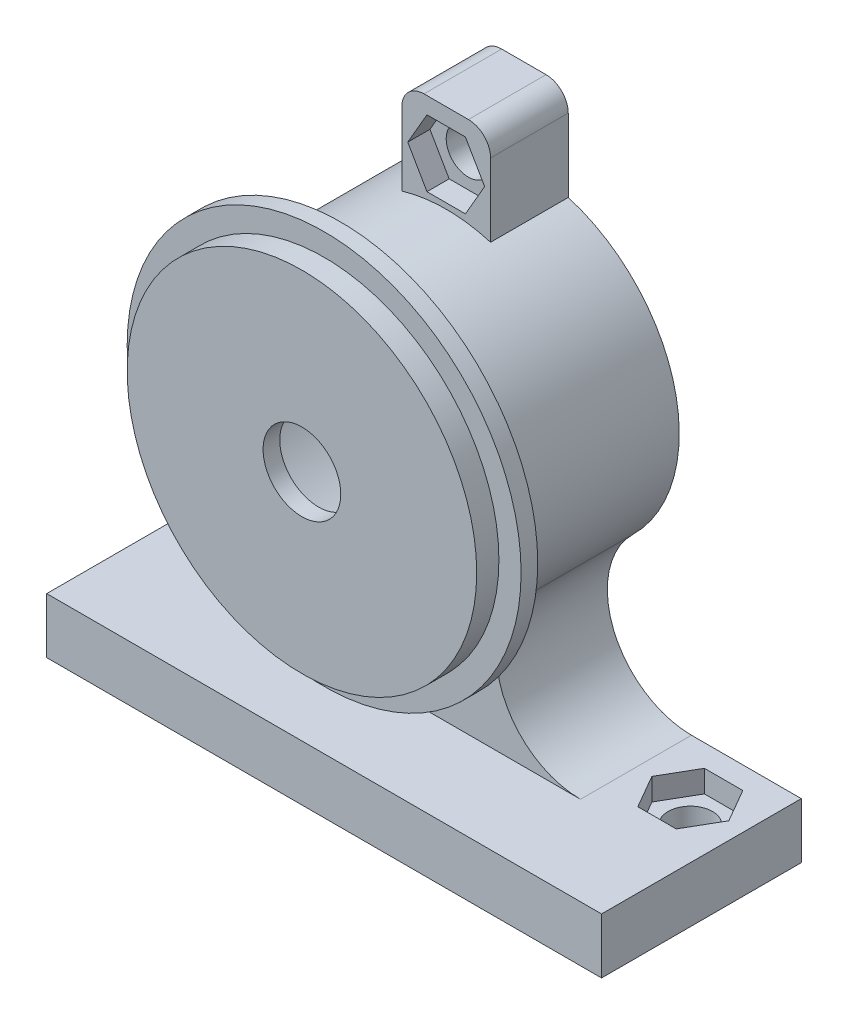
ISO-10303-21;
HEADER;
FILE_DESCRIPTION(('STEP AP214'),'2;1');
FILE_NAME('part.step','',(''),(''),'','','');
FILE_SCHEMA(('AUTOMOTIVE_DESIGN { 1 0 10303 214 1 1 1 1 }'));
ENDSEC;
DATA;
#1=APPLICATION_CONTEXT('core data for automotive mechanical design processes');
#2=APPLICATION_PROTOCOL_DEFINITION('international standard','automotive_design',2000,#1);
#3=PRODUCT_CONTEXT('',#1,'mechanical');
#4=PRODUCT('Part','Part','',(#3));
#5=PRODUCT_RELATED_PRODUCT_CATEGORY('part','',(#4));
#6=PRODUCT_DEFINITION_FORMATION('','',#4);
#7=PRODUCT_DEFINITION_CONTEXT('part definition',#1,'design');
#8=PRODUCT_DEFINITION('design','',#6,#7);
#9=PRODUCT_DEFINITION_SHAPE('','',#8);
#10=(LENGTH_UNIT() NAMED_UNIT(*) SI_UNIT(.MILLI.,.METRE.));
#11=(NAMED_UNIT(*) PLANE_ANGLE_UNIT() SI_UNIT($,.RADIAN.));
#12=(NAMED_UNIT(*) SI_UNIT($,.STERADIAN.) SOLID_ANGLE_UNIT());
#13=UNCERTAINTY_MEASURE_WITH_UNIT(LENGTH_MEASURE(1.E-05),#10,'distance_accuracy_value','');
#14=(GEOMETRIC_REPRESENTATION_CONTEXT(3) GLOBAL_UNCERTAINTY_ASSIGNED_CONTEXT((#13)) GLOBAL_UNIT_ASSIGNED_CONTEXT((#10,
#11,#12)) REPRESENTATION_CONTEXT('',''));
#15=CARTESIAN_POINT('',(0.,0.,0.));
#16=DIRECTION('',(0.,0.,1.));
#17=DIRECTION('',(1.,0.,0.));
#18=AXIS2_PLACEMENT_3D('',#15,#16,#17);
#19=CARTESIAN_POINT('',(20.,-28.,4.99999999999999));
#20=DIRECTION('',(0.,1.,0.));
#21=DIRECTION('',(-1.,0.,0.));
#22=AXIS2_PLACEMENT_3D('',#19,#20,#21);
#23=CYLINDRICAL_SURFACE('',#22,2.);
#24=CARTESIAN_POINT('',(20.,-28.,4.99999999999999));
#25=DIRECTION('',(0.,1.,0.));
#26=DIRECTION('',(-1.,0.,0.));
#27=AXIS2_PLACEMENT_3D('',#24,#25,#26);
#28=CIRCLE('',#27,2.);
#29=CARTESIAN_POINT('',(18.,-28.,4.99999999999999));
#30=VERTEX_POINT('',#29);
#31=EDGE_CURVE('E391',#30,#30,#28,.T.);
#32=ORIENTED_EDGE('',*,*,#31,.F.);
#33=EDGE_LOOP('',(#32));
#34=FACE_BOUND('',#33,.T.);
#35=CARTESIAN_POINT('',(20.,-25.,4.99999999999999));
#36=DIRECTION('',(0.,1.,0.));
#37=DIRECTION('',(0.,0.,1.));
#38=AXIS2_PLACEMENT_3D('',#35,#36,#37);
#39=CIRCLE('',#38,2.);
#40=CARTESIAN_POINT('',(20.,-25.,6.99999999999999));
#41=VERTEX_POINT('',#40);
#42=EDGE_CURVE('E44',#41,#41,#39,.F.);
#43=ORIENTED_EDGE('',*,*,#42,.F.);
#44=EDGE_LOOP('',(#43));
#45=FACE_BOUND('',#44,.T.);
#46=ADVANCED_FACE('F40',(#34,#45),#23,.F.);
#47=CARTESIAN_POINT('',(-20.,-28.,5.));
#48=DIRECTION('',(0.,1.,0.));
#49=DIRECTION('',(-1.,0.,0.));
#50=AXIS2_PLACEMENT_3D('',#47,#48,#49);
#51=CYLINDRICAL_SURFACE('',#50,2.);
#52=CARTESIAN_POINT('',(-20.,-28.,5.));
#53=DIRECTION('',(0.,1.,0.));
#54=DIRECTION('',(-1.,0.,0.));
#55=AXIS2_PLACEMENT_3D('',#52,#53,#54);
#56=CIRCLE('',#55,2.);
#57=CARTESIAN_POINT('',(-22.,-28.,5.));
#58=VERTEX_POINT('',#57);
#59=EDGE_CURVE('E388',#58,#58,#56,.T.);
#60=ORIENTED_EDGE('',*,*,#59,.F.);
#61=EDGE_LOOP('',(#60));
#62=FACE_BOUND('',#61,.T.);
#63=CARTESIAN_POINT('',(-20.,-25.,5.));
#64=DIRECTION('',(0.,1.,0.));
#65=DIRECTION('',(0.,0.,1.));
#66=AXIS2_PLACEMENT_3D('',#63,#64,#65);
#67=CIRCLE('',#66,2.);
#68=CARTESIAN_POINT('',(-20.,-25.,7.));
#69=VERTEX_POINT('',#68);
#70=EDGE_CURVE('E378',#69,#69,#67,.F.);
#71=ORIENTED_EDGE('',*,*,#70,.F.);
#72=EDGE_LOOP('',(#71));
#73=FACE_BOUND('',#72,.T.);
#74=ADVANCED_FACE('F661',(#62,#73),#51,.F.);
#75=CARTESIAN_POINT('',(0.,0.,10.));
#76=DIRECTION('',(0.,0.,1.));
#77=DIRECTION('',(1.,0.,0.));
#78=AXIS2_PLACEMENT_3D('',#75,#76,#77);
#79=PLANE('',#78);
#80=DIRECTION('',(0.5,0.866025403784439,0.));
#81=VECTOR('',#80,1.);
#82=CARTESIAN_POINT('',(1.73205080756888,-21.,10.));
#83=LINE('',#82,#81);
#84=CARTESIAN_POINT('',(1.73205080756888,-21.,10.));
#85=VERTEX_POINT('',#84);
#86=CARTESIAN_POINT('',(3.46410161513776,-18.,10.));
#87=VERTEX_POINT('',#86);
#88=EDGE_CURVE('E477',#85,#87,#83,.T.);
#89=ORIENTED_EDGE('',*,*,#88,.F.);
#90=DIRECTION('',(1.,0.,0.));
#91=VECTOR('',#90,1.);
#92=CARTESIAN_POINT('',(-1.73205080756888,-21.,10.));
#93=LINE('',#92,#91);
#94=CARTESIAN_POINT('',(-1.73205080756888,-21.,10.));
#95=VERTEX_POINT('',#94);
#96=EDGE_CURVE('E461',#95,#85,#93,.T.);
#97=ORIENTED_EDGE('',*,*,#96,.F.);
#98=DIRECTION('',(0.5,-0.866025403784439,0.));
#99=VECTOR('',#98,1.);
#100=CARTESIAN_POINT('',(-3.46410161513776,-18.,10.));
#101=LINE('',#100,#99);
#102=CARTESIAN_POINT('',(-3.46410161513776,-18.,10.));
#103=VERTEX_POINT('',#102);
#104=EDGE_CURVE('E488',#103,#95,#101,.T.);
#105=ORIENTED_EDGE('',*,*,#104,.F.);
#106=DIRECTION('',(-0.5,-0.866025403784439,0.));
#107=VECTOR('',#106,1.);
#108=CARTESIAN_POINT('',(-1.73205080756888,-15.,10.));
#109=LINE('',#108,#107);
#110=CARTESIAN_POINT('',(-1.73205080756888,-15.,10.));
#111=VERTEX_POINT('',#110);
#112=EDGE_CURVE('E485',#111,#103,#109,.T.);
#113=ORIENTED_EDGE('',*,*,#112,.F.);
#114=DIRECTION('',(-1.,0.,0.));
#115=VECTOR('',#114,1.);
#116=CARTESIAN_POINT('',(1.73205080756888,-15.,10.));
#117=LINE('',#116,#115);
#118=CARTESIAN_POINT('',(1.73205080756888,-15.,10.));
#119=VERTEX_POINT('',#118);
#120=EDGE_CURVE('E482',#119,#111,#117,.T.);
#121=ORIENTED_EDGE('',*,*,#120,.F.);
#122=DIRECTION('',(-0.5,0.866025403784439,0.));
#123=VECTOR('',#122,1.);
#124=CARTESIAN_POINT('',(3.46410161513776,-18.,10.));
#125=LINE('',#124,#123);
#126=EDGE_CURVE('E479',#87,#119,#125,.T.);
#127=ORIENTED_EDGE('',*,*,#126,.F.);
#128=EDGE_LOOP('',(#89,#97,#105,#113,#121,#127));
#129=FACE_BOUND('',#128,.T.);
#130=CARTESIAN_POINT('',(-15.1051867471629,-15.4166666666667,10.));
#131=DIRECTION('',(0.,0.,1.));
#132=DIRECTION('',(1.,0.,0.));
#133=AXIS2_PLACEMENT_3D('',#130,#131,#132);
#134=CIRCLE('',#133,7.58333333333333);
#135=CARTESIAN_POINT('',(-9.79795897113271,-10.,10.));
#136=VERTEX_POINT('',#135);
#137=CARTESIAN_POINT('',(-15.1051867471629,-23.,10.));
#138=VERTEX_POINT('',#137);
#139=EDGE_CURVE('E563',#136,#138,#134,.F.);
#140=ORIENTED_EDGE('',*,*,#139,.T.);
#141=DIRECTION('',(1.,0.,0.));
#142=VECTOR('',#141,1.);
#143=CARTESIAN_POINT('',(0.,-23.,10.));
#144=LINE('',#143,#142);
#145=CARTESIAN_POINT('',(15.1051867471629,-23.,10.));
#146=VERTEX_POINT('',#145);
#147=EDGE_CURVE('E13',#138,#146,#144,.T.);
#148=ORIENTED_EDGE('',*,*,#147,.T.);
#149=CARTESIAN_POINT('',(15.1051867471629,-15.4166666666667,10.));
#150=DIRECTION('',(0.,0.,1.));
#151=DIRECTION('',(1.,0.,0.));
#152=AXIS2_PLACEMENT_3D('',#149,#150,#151);
#153=CIRCLE('',#152,7.58333333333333);
#154=CARTESIAN_POINT('',(9.79795897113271,-10.,10.));
#155=VERTEX_POINT('',#154);
#156=EDGE_CURVE('E558',#155,#146,#153,.T.);
#157=ORIENTED_EDGE('',*,*,#156,.F.);
#158=CARTESIAN_POINT('',(0.,0.,10.));
#159=DIRECTION('',(0.,0.,1.));
#160=DIRECTION('',(1.,0.,0.));
#161=AXIS2_PLACEMENT_3D('',#158,#159,#160);
#162=CIRCLE('',#161,14.);
#163=EDGE_CURVE('E561',#136,#155,#162,.T.);
#164=ORIENTED_EDGE('',*,*,#163,.F.);
#165=EDGE_LOOP('',(#140,#148,#157,#164));
#166=FACE_BOUND('',#165,.T.);
#167=ADVANCED_FACE('F663',(#129,#166),#79,.T.);
#168=CARTESIAN_POINT('',(0.,0.,20.));
#169=DIRECTION('',(0.,0.,-1.));
#170=DIRECTION('',(-1.,0.,0.));
#171=AXIS2_PLACEMENT_3D('',#168,#169,#170);
#172=CYLINDRICAL_SURFACE('',#171,14.);
#173=CARTESIAN_POINT('',(0.,0.,16.5));
#174=DIRECTION('',(0.,0.,-1.));
#175=DIRECTION('',(-1.,0.,0.));
#176=AXIS2_PLACEMENT_3D('',#173,#174,#175);
#177=CIRCLE('',#176,14.);
#178=CARTESIAN_POINT('',(-14.,0.,16.5));
#179=VERTEX_POINT('',#178);
#180=EDGE_CURVE('E404',#179,#179,#177,.T.);
#181=ORIENTED_EDGE('',*,*,#180,.T.);
#182=EDGE_LOOP('',(#181));
#183=FACE_BOUND('',#182,.T.);
#184=CARTESIAN_POINT('',(0.,0.,0.));
#185=DIRECTION('',(0.,0.,1.));
#186=DIRECTION('',(1.,0.,0.));
#187=AXIS2_PLACEMENT_3D('',#184,#185,#186);
#188=CIRCLE('',#187,14.);
#189=CARTESIAN_POINT('',(9.79795897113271,-10.,0.));
#190=VERTEX_POINT('',#189);
#191=CARTESIAN_POINT('',(4.,13.4164078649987,0.));
#192=VERTEX_POINT('',#191);
#193=EDGE_CURVE('E624',#190,#192,#188,.T.);
#194=ORIENTED_EDGE('',*,*,#193,.T.);
#195=DIRECTION('',(0.,0.,-1.));
#196=VECTOR('',#195,1.);
#197=CARTESIAN_POINT('',(4.,13.4164078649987,7.));
#198=LINE('',#197,#196);
#199=CARTESIAN_POINT('',(4.,13.4164078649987,7.));
#200=VERTEX_POINT('',#199);
#201=EDGE_CURVE('E542',#200,#192,#198,.T.);
#202=ORIENTED_EDGE('',*,*,#201,.F.);
#203=CARTESIAN_POINT('',(0.,0.,7.));
#204=DIRECTION('',(0.,0.,1.));
#205=DIRECTION('',(-1.,0.,0.));
#206=AXIS2_PLACEMENT_3D('',#203,#204,#205);
#207=CIRCLE('',#206,14.);
#208=CARTESIAN_POINT('',(-3.99999999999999,13.4164078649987,7.));
#209=VERTEX_POINT('',#208);
#210=EDGE_CURVE('E510',#200,#209,#207,.T.);
#211=ORIENTED_EDGE('',*,*,#210,.T.);
#212=DIRECTION('',(0.,0.,-1.));
#213=VECTOR('',#212,1.);
#214=CARTESIAN_POINT('',(-3.99999999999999,13.4164078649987,7.));
#215=LINE('',#214,#213);
#216=CARTESIAN_POINT('',(-3.99999999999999,13.4164078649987,0.));
#217=VERTEX_POINT('',#216);
#218=EDGE_CURVE('E528',#209,#217,#215,.T.);
#219=ORIENTED_EDGE('',*,*,#218,.T.);
#220=CARTESIAN_POINT('',(-9.79795897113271,-10.,0.));
#221=VERTEX_POINT('',#220);
#222=EDGE_CURVE('E623',#217,#221,#188,.T.);
#223=ORIENTED_EDGE('',*,*,#222,.T.);
#224=DIRECTION('',(0.,0.,1.));
#225=VECTOR('',#224,1.);
#226=CARTESIAN_POINT('',(-9.79795897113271,-10.,0.));
#227=LINE('',#226,#225);
#228=EDGE_CURVE('E599',#221,#136,#227,.T.);
#229=ORIENTED_EDGE('',*,*,#228,.T.);
#230=ORIENTED_EDGE('',*,*,#163,.T.);
#231=DIRECTION('',(0.,0.,1.));
#232=VECTOR('',#231,1.);
#233=CARTESIAN_POINT('',(9.79795897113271,-10.,0.));
#234=LINE('',#233,#232);
#235=EDGE_CURVE('E583',#190,#155,#234,.T.);
#236=ORIENTED_EDGE('',*,*,#235,.F.);
#237=EDGE_LOOP('',(#194,#202,#211,#219,#223,#229,#230,#236));
#238=FACE_BOUND('',#237,.T.);
#239=ADVANCED_FACE('F42',(#183,#238),#172,.T.);
#240=CARTESIAN_POINT('',(0.,17.5,7.));
#241=DIRECTION('',(0.,0.,-1.));
#242=DIRECTION('',(-1.,0.,0.));
#243=AXIS2_PLACEMENT_3D('',#240,#241,#242);
#244=CYLINDRICAL_SURFACE('',#243,2.);
#245=CARTESIAN_POINT('',(0.,17.5,0.));
#246=DIRECTION('',(0.,0.,-1.));
#247=DIRECTION('',(-1.,0.,0.));
#248=AXIS2_PLACEMENT_3D('',#245,#246,#247);
#249=CIRCLE('',#248,2.);
#250=CARTESIAN_POINT('',(-2.,17.5,0.));
#251=VERTEX_POINT('',#250);
#252=EDGE_CURVE('E506',#251,#251,#249,.T.);
#253=CARTESIAN_POINT('',(0.,17.5,5.));
#254=DIRECTION('',(0.,0.,1.));
#255=DIRECTION('',(1.,0.,0.));
#256=AXIS2_PLACEMENT_3D('',#253,#254,#255);
#257=CIRCLE('',#256,2.);
#258=CARTESIAN_POINT('',(-2.,17.5,5.));
#259=VERTEX_POINT('',#258);
#260=EDGE_CURVE('E443',#259,#259,#257,.F.);
#261=CARTESIAN_POINT('',(-2.,17.5,0.));
#262=CARTESIAN_POINT('',(-2.,17.5,0.0520833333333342));
#263=CARTESIAN_POINT('',(-2.,17.5,0.104166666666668));
#264=CARTESIAN_POINT('',(-2.,17.5,0.208333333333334));
#265=CARTESIAN_POINT('',(-2.,17.5,0.260416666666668));
#266=CARTESIAN_POINT('',(-2.,17.5,0.364583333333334));
#267=CARTESIAN_POINT('',(-2.,17.5,0.416666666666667));
#268=CARTESIAN_POINT('',(-2.,17.5,0.520833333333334));
#269=CARTESIAN_POINT('',(-2.,17.5,0.572916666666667));
#270=CARTESIAN_POINT('',(-2.,17.5,0.677083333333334));
#271=CARTESIAN_POINT('',(-2.,17.5,0.729166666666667));
#272=CARTESIAN_POINT('',(-2.,17.5,0.833333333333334));
#273=CARTESIAN_POINT('',(-2.,17.5,0.885416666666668));
#274=CARTESIAN_POINT('',(-2.,17.5,0.989583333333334));
#275=CARTESIAN_POINT('',(-2.,17.5,1.04166666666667));
#276=CARTESIAN_POINT('',(-2.,17.5,1.14583333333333));
#277=CARTESIAN_POINT('',(-2.,17.5,1.19791666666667));
#278=CARTESIAN_POINT('',(-2.,17.5,1.30208333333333));
#279=CARTESIAN_POINT('',(-2.,17.5,1.35416666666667));
#280=CARTESIAN_POINT('',(-2.,17.5,1.45833333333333));
#281=CARTESIAN_POINT('',(-2.,17.5,1.51041666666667));
#282=CARTESIAN_POINT('',(-2.,17.5,1.61458333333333));
#283=CARTESIAN_POINT('',(-2.,17.5,1.66666666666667));
#284=CARTESIAN_POINT('',(-2.,17.5,1.77083333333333));
#285=CARTESIAN_POINT('',(-2.,17.5,1.82291666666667));
#286=CARTESIAN_POINT('',(-2.,17.5,1.92708333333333));
#287=CARTESIAN_POINT('',(-2.,17.5,1.97916666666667));
#288=CARTESIAN_POINT('',(-2.,17.5,2.08333333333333));
#289=CARTESIAN_POINT('',(-2.,17.5,2.13541666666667));
#290=CARTESIAN_POINT('',(-2.,17.5,2.23958333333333));
#291=CARTESIAN_POINT('',(-2.,17.5,2.29166666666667));
#292=CARTESIAN_POINT('',(-2.,17.5,2.39583333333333));
#293=CARTESIAN_POINT('',(-2.,17.5,2.44791666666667));
#294=CARTESIAN_POINT('',(-2.,17.5,2.55208333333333));
#295=CARTESIAN_POINT('',(-2.,17.5,2.60416666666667));
#296=CARTESIAN_POINT('',(-2.,17.5,2.70833333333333));
#297=CARTESIAN_POINT('',(-2.,17.5,2.76041666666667));
#298=CARTESIAN_POINT('',(-2.,17.5,2.86458333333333));
#299=CARTESIAN_POINT('',(-2.,17.5,2.91666666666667));
#300=CARTESIAN_POINT('',(-2.,17.5,3.02083333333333));
#301=CARTESIAN_POINT('',(-2.,17.5,3.07291666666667));
#302=CARTESIAN_POINT('',(-2.,17.5,3.17708333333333));
#303=CARTESIAN_POINT('',(-2.,17.5,3.22916666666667));
#304=CARTESIAN_POINT('',(-2.,17.5,3.33333333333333));
#305=CARTESIAN_POINT('',(-2.,17.5,3.38541666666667));
#306=CARTESIAN_POINT('',(-2.,17.5,3.48958333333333));
#307=CARTESIAN_POINT('',(-2.,17.5,3.54166666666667));
#308=CARTESIAN_POINT('',(-2.,17.5,3.64583333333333));
#309=CARTESIAN_POINT('',(-2.,17.5,3.69791666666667));
#310=CARTESIAN_POINT('',(-2.,17.5,3.80208333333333));
#311=CARTESIAN_POINT('',(-2.,17.5,3.85416666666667));
#312=CARTESIAN_POINT('',(-2.,17.5,3.95833333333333));
#313=CARTESIAN_POINT('',(-2.,17.5,4.01041666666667));
#314=CARTESIAN_POINT('',(-2.,17.5,4.11458333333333));
#315=CARTESIAN_POINT('',(-2.,17.5,4.16666666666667));
#316=CARTESIAN_POINT('',(-2.,17.5,4.27083333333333));
#317=CARTESIAN_POINT('',(-2.,17.5,4.32291666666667));
#318=CARTESIAN_POINT('',(-2.,17.5,4.42708333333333));
#319=CARTESIAN_POINT('',(-2.,17.5,4.47916666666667));
#320=CARTESIAN_POINT('',(-2.,17.5,4.58333333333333));
#321=CARTESIAN_POINT('',(-2.,17.5,4.63541666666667));
#322=CARTESIAN_POINT('',(-2.,17.5,4.73958333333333));
#323=CARTESIAN_POINT('',(-2.,17.5,4.79166666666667));
#324=CARTESIAN_POINT('',(-2.,17.5,4.89583333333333));
#325=CARTESIAN_POINT('',(-2.,17.5,4.94791666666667));
#326=CARTESIAN_POINT('',(-2.,17.5,5.));
#327=B_SPLINE_CURVE_WITH_KNOTS('',3,(#261,#262,#263,#264,#265,#266,#267,#268,#269,#270,#271,
#272,#273,#274,#275,#276,#277,#278,#279,#280,#281,#282,#283,#284,#285,#286,#287,#288,#289,#290,
#291,#292,#293,#294,#295,#296,#297,#298,#299,#300,#301,#302,#303,#304,#305,#306,#307,#308,#309,
#310,#311,#312,#313,#314,#315,#316,#317,#318,#319,#320,#321,#322,#323,#324,#325,#326),
.UNSPECIFIED.,.F.,.F.,(4,2,2,2,2,2,2,2,2,2,2,2,2,2,2,2,2,2,2,2,2,2,2,2,2,2,2,2,2,2,2,2,4),(0.,
0.15625,0.3125,0.46875,0.625,0.78125,0.9375,1.09375,1.25,1.40625,1.5625,1.71875,1.875,2.03125,
2.1875,2.34375,2.5,2.65625,2.8125,2.96875,3.125,3.28125,3.4375,3.59375,3.75,3.90625,4.0625,
4.21875,4.375,4.53125,4.6875,4.84375,5.),.UNSPECIFIED.);
#328=EDGE_CURVE('BSEAM756',#251,#259,#327,.T.);
#329=ORIENTED_EDGE('',*,*,#252,.T.);
#330=ORIENTED_EDGE('',*,*,#260,.F.);
#331=ORIENTED_EDGE('',*,*,#328,.T.);
#332=ORIENTED_EDGE('',*,*,#328,.F.);
#333=EDGE_LOOP('',(#329,#331,#330,#332));
#334=FACE_BOUND('',#333,.T.);
#335=ADVANCED_FACE('F756',(#334),#244,.F.);
#336=CARTESIAN_POINT('',(0.,-18.,0.));
#337=DIRECTION('',(0.,0.,1.));
#338=DIRECTION('',(1.,0.,0.));
#339=AXIS2_PLACEMENT_3D('',#336,#337,#338);
#340=CYLINDRICAL_SURFACE('',#339,2.);
#341=CARTESIAN_POINT('',(0.,-18.,0.));
#342=DIRECTION('',(0.,0.,1.));
#343=DIRECTION('',(1.,0.,0.));
#344=AXIS2_PLACEMENT_3D('',#341,#342,#343);
#345=CIRCLE('',#344,2.);
#346=CARTESIAN_POINT('',(2.,-18.,0.));
#347=VERTEX_POINT('',#346);
#348=EDGE_CURVE('E545',#347,#347,#345,.T.);
#349=ORIENTED_EDGE('',*,*,#348,.F.);
#350=EDGE_LOOP('',(#349));
#351=FACE_BOUND('',#350,.T.);
#352=CARTESIAN_POINT('',(0.,-18.,5.));
#353=DIRECTION('',(0.,0.,1.));
#354=DIRECTION('',(1.,0.,0.));
#355=AXIS2_PLACEMENT_3D('',#352,#353,#354);
#356=CIRCLE('',#355,2.);
#357=CARTESIAN_POINT('',(2.,-18.,5.));
#358=VERTEX_POINT('',#357);
#359=EDGE_CURVE('E495',#358,#358,#356,.F.);
#360=ORIENTED_EDGE('',*,*,#359,.F.);
#361=EDGE_LOOP('',(#360));
#362=FACE_BOUND('',#361,.T.);
#363=ADVANCED_FACE('F759',(#351,#362),#340,.F.);
#364=CARTESIAN_POINT('',(0.,0.,20.));
#365=DIRECTION('',(0.,0.,1.));
#366=DIRECTION('',(1.,0.,0.));
#367=AXIS2_PLACEMENT_3D('',#364,#365,#366);
#368=PLANE('',#367);
#369=CARTESIAN_POINT('',(0.,0.,20.));
#370=DIRECTION('',(0.,0.,1.));
#371=DIRECTION('',(1.,0.,0.));
#372=AXIS2_PLACEMENT_3D('',#369,#370,#371);
#373=CIRCLE('',#372,3.5);
#374=CARTESIAN_POINT('',(3.5,0.,20.));
#375=VERTEX_POINT('',#374);
#376=EDGE_CURVE('E620',#375,#375,#373,.T.);
#377=ORIENTED_EDGE('',*,*,#376,.F.);
#378=EDGE_LOOP('',(#377));
#379=FACE_BOUND('',#378,.T.);
#380=CARTESIAN_POINT('',(0.,0.,20.));
#381=DIRECTION('',(0.,0.,1.));
#382=DIRECTION('',(1.,0.,0.));
#383=AXIS2_PLACEMENT_3D('',#380,#381,#382);
#384=CIRCLE('',#383,15.75);
#385=CARTESIAN_POINT('',(15.75,0.,20.));
#386=VERTEX_POINT('',#385);
#387=EDGE_CURVE('E418',#386,#386,#384,.T.);
#388=ORIENTED_EDGE('',*,*,#387,.T.);
#389=EDGE_LOOP('',(#388));
#390=FACE_BOUND('',#389,.T.);
#391=ADVANCED_FACE('F786',(#379,#390),#368,.T.);
#392=CARTESIAN_POINT('',(15.1051867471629,-15.4166666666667,0.));
#393=DIRECTION('',(0.,0.,1.));
#394=DIRECTION('',(1.,0.,0.));
#395=AXIS2_PLACEMENT_3D('',#392,#393,#394);
#396=CYLINDRICAL_SURFACE('',#395,7.58333333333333);
#397=ORIENTED_EDGE('',*,*,#156,.T.);
#398=DIRECTION('',(0.,0.,1.));
#399=VECTOR('',#398,1.);
#400=CARTESIAN_POINT('',(15.1051867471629,-23.,0.));
#401=LINE('',#400,#399);
#402=CARTESIAN_POINT('',(15.1051867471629,-23.,0.));
#403=VERTEX_POINT('',#402);
#404=EDGE_CURVE('E584',#403,#146,#401,.T.);
#405=ORIENTED_EDGE('',*,*,#404,.F.);
#406=CARTESIAN_POINT('',(15.1051867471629,-15.4166666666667,0.));
#407=DIRECTION('',(0.,0.,1.));
#408=DIRECTION('',(1.,0.,0.));
#409=AXIS2_PLACEMENT_3D('',#406,#407,#408);
#410=CIRCLE('',#409,7.58333333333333);
#411=EDGE_CURVE('E565',#190,#403,#410,.T.);
#412=ORIENTED_EDGE('',*,*,#411,.F.);
#413=ORIENTED_EDGE('',*,*,#235,.T.);
#414=EDGE_LOOP('',(#397,#405,#412,#413));
#415=FACE_BOUND('',#414,.T.);
#416=ADVANCED_FACE('F793',(#415),#396,.F.);
#417=CARTESIAN_POINT('',(25.,0.,0.));
#418=DIRECTION('',(1.,0.,0.));
#419=DIRECTION('',(0.,0.,-1.));
#420=AXIS2_PLACEMENT_3D('',#417,#418,#419);
#421=PLANE('',#420);
#422=DIRECTION('',(0.,0.,1.));
#423=VECTOR('',#422,1.);
#424=CARTESIAN_POINT('',(25.,-23.,0.));
#425=LINE('',#424,#423);
#426=CARTESIAN_POINT('',(25.,-23.,0.));
#427=VERTEX_POINT('',#426);
#428=CARTESIAN_POINT('',(25.,-23.,18.));
#429=VERTEX_POINT('',#428);
#430=EDGE_CURVE('E588',#427,#429,#425,.T.);
#431=ORIENTED_EDGE('',*,*,#430,.T.);
#432=DIRECTION('',(0.,-1.,0.));
#433=VECTOR('',#432,1.);
#434=CARTESIAN_POINT('',(25.,-28.,18.));
#435=LINE('',#434,#433);
#436=CARTESIAN_POINT('',(25.,-28.,18.));
#437=VERTEX_POINT('',#436);
#438=EDGE_CURVE('E401',#429,#437,#435,.T.);
#439=ORIENTED_EDGE('',*,*,#438,.T.);
#440=DIRECTION('',(0.,0.,1.));
#441=VECTOR('',#440,1.);
#442=CARTESIAN_POINT('',(25.,-28.,0.));
#443=LINE('',#442,#441);
#444=CARTESIAN_POINT('',(25.,-28.,0.));
#445=VERTEX_POINT('',#444);
#446=EDGE_CURVE('E590',#445,#437,#443,.T.);
#447=ORIENTED_EDGE('',*,*,#446,.F.);
#448=DIRECTION('',(0.,1.,0.));
#449=VECTOR('',#448,1.);
#450=CARTESIAN_POINT('',(25.,0.,0.));
#451=LINE('',#450,#449);
#452=EDGE_CURVE('E578',#445,#427,#451,.T.);
#453=ORIENTED_EDGE('',*,*,#452,.T.);
#454=EDGE_LOOP('',(#431,#439,#447,#453));
#455=FACE_BOUND('',#454,.T.);
#456=ADVANCED_FACE('F789',(#455),#421,.T.);
#457=CARTESIAN_POINT('',(0.,-28.,0.));
#458=DIRECTION('',(0.,-1.,0.));
#459=DIRECTION('',(1.,0.,0.));
#460=AXIS2_PLACEMENT_3D('',#457,#458,#459);
#461=PLANE('',#460);
#462=ORIENTED_EDGE('',*,*,#59,.T.);
#463=EDGE_LOOP('',(#462));
#464=FACE_BOUND('',#463,.T.);
#465=ORIENTED_EDGE('',*,*,#31,.T.);
#466=EDGE_LOOP('',(#465));
#467=FACE_BOUND('',#466,.T.);
#468=ORIENTED_EDGE('',*,*,#446,.T.);
#469=DIRECTION('',(-1.,0.,0.));
#470=VECTOR('',#469,1.);
#471=CARTESIAN_POINT('',(25.,-28.,18.));
#472=LINE('',#471,#470);
#473=CARTESIAN_POINT('',(-25.,-28.,18.));
#474=VERTEX_POINT('',#473);
#475=EDGE_CURVE('E394',#437,#474,#472,.T.);
#476=ORIENTED_EDGE('',*,*,#475,.T.);
#477=DIRECTION('',(0.,0.,1.));
#478=VECTOR('',#477,1.);
#479=CARTESIAN_POINT('',(-25.,-28.,0.));
#480=LINE('',#479,#478);
#481=CARTESIAN_POINT('',(-25.,-28.,0.));
#482=VERTEX_POINT('',#481);
#483=EDGE_CURVE('E592',#482,#474,#480,.T.);
#484=ORIENTED_EDGE('',*,*,#483,.F.);
#485=DIRECTION('',(1.,0.,0.));
#486=VECTOR('',#485,1.);
#487=CARTESIAN_POINT('',(0.,-28.,0.));
#488=LINE('',#487,#486);
#489=EDGE_CURVE('E575',#482,#445,#488,.T.);
#490=ORIENTED_EDGE('',*,*,#489,.T.);
#491=EDGE_LOOP('',(#468,#476,#484,#490));
#492=FACE_BOUND('',#491,.T.);
#493=ADVANCED_FACE('F792',(#464,#467,#492),#461,.T.);
#494=CARTESIAN_POINT('',(-25.,0.,0.));
#495=DIRECTION('',(1.,0.,0.));
#496=DIRECTION('',(0.,0.,-1.));
#497=AXIS2_PLACEMENT_3D('',#494,#495,#496);
#498=PLANE('',#497);
#499=ORIENTED_EDGE('',*,*,#483,.T.);
#500=DIRECTION('',(0.,1.,0.));
#501=VECTOR('',#500,1.);
#502=CARTESIAN_POINT('',(-25.,-28.,18.));
#503=LINE('',#502,#501);
#504=CARTESIAN_POINT('',(-25.,-23.,18.));
#505=VERTEX_POINT('',#504);
#506=EDGE_CURVE('E395',#474,#505,#503,.T.);
#507=ORIENTED_EDGE('',*,*,#506,.T.);
#508=DIRECTION('',(0.,0.,1.));
#509=VECTOR('',#508,1.);
#510=CARTESIAN_POINT('',(-25.,-23.,0.));
#511=LINE('',#510,#509);
#512=CARTESIAN_POINT('',(-25.,-23.,0.));
#513=VERTEX_POINT('',#512);
#514=EDGE_CURVE('E594',#513,#505,#511,.T.);
#515=ORIENTED_EDGE('',*,*,#514,.F.);
#516=DIRECTION('',(0.,1.,0.));
#517=VECTOR('',#516,1.);
#518=CARTESIAN_POINT('',(-25.,0.,0.));
#519=LINE('',#518,#517);
#520=EDGE_CURVE('E573',#482,#513,#519,.T.);
#521=ORIENTED_EDGE('',*,*,#520,.F.);
#522=EDGE_LOOP('',(#499,#507,#515,#521));
#523=FACE_BOUND('',#522,.T.);
#524=ADVANCED_FACE('F797',(#523),#498,.F.);
#525=CARTESIAN_POINT('',(0.,-23.,0.));
#526=DIRECTION('',(0.,-1.,0.));
#527=DIRECTION('',(1.,0.,0.));
#528=AXIS2_PLACEMENT_3D('',#525,#526,#527);
#529=PLANE('',#528);
#530=DIRECTION('',(-0.5,0.,-0.866025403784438));
#531=VECTOR('',#530,1.);
#532=CARTESIAN_POINT('',(23.4641016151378,-23.,4.99999999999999));
#533=LINE('',#532,#531);
#534=CARTESIAN_POINT('',(23.4641016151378,-23.,4.99999999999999));
#535=VERTEX_POINT('',#534);
#536=CARTESIAN_POINT('',(21.7320508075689,-23.,1.99999999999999));
#537=VERTEX_POINT('',#536);
#538=EDGE_CURVE('E322',#535,#537,#533,.T.);
#539=ORIENTED_EDGE('',*,*,#538,.F.);
#540=DIRECTION('',(0.5,0.,-0.866025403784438));
#541=VECTOR('',#540,1.);
#542=CARTESIAN_POINT('',(21.7320508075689,-23.,7.99999999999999));
#543=LINE('',#542,#541);
#544=CARTESIAN_POINT('',(21.7320508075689,-23.,7.99999999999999));
#545=VERTEX_POINT('',#544);
#546=EDGE_CURVE('E57',#545,#535,#543,.T.);
#547=ORIENTED_EDGE('',*,*,#546,.F.);
#548=DIRECTION('',(1.,0.,0.));
#549=VECTOR('',#548,1.);
#550=CARTESIAN_POINT('',(18.2679491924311,-23.,7.99999999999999));
#551=LINE('',#550,#549);
#552=CARTESIAN_POINT('',(18.2679491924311,-23.,7.99999999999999));
#553=VERTEX_POINT('',#552);
#554=EDGE_CURVE('E308',#553,#545,#551,.T.);
#555=ORIENTED_EDGE('',*,*,#554,.F.);
#556=DIRECTION('',(0.5,0.,0.866025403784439));
#557=VECTOR('',#556,1.);
#558=CARTESIAN_POINT('',(16.5358983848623,-23.,4.99999999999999));
#559=LINE('',#558,#557);
#560=CARTESIAN_POINT('',(16.5358983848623,-23.,4.99999999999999));
#561=VERTEX_POINT('',#560);
#562=EDGE_CURVE('E311',#561,#553,#559,.T.);
#563=ORIENTED_EDGE('',*,*,#562,.F.);
#564=DIRECTION('',(-0.500000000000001,0.,0.866025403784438));
#565=VECTOR('',#564,1.);
#566=CARTESIAN_POINT('',(18.2679491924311,-23.,1.99999999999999));
#567=LINE('',#566,#565);
#568=CARTESIAN_POINT('',(18.2679491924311,-23.,1.99999999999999));
#569=VERTEX_POINT('',#568);
#570=EDGE_CURVE('E327',#569,#561,#567,.T.);
#571=ORIENTED_EDGE('',*,*,#570,.F.);
#572=DIRECTION('',(-1.,0.,0.));
#573=VECTOR('',#572,1.);
#574=CARTESIAN_POINT('',(21.7320508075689,-23.,1.99999999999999));
#575=LINE('',#574,#573);
#576=EDGE_CURVE('E324',#537,#569,#575,.T.);
#577=ORIENTED_EDGE('',*,*,#576,.F.);
#578=EDGE_LOOP('',(#539,#547,#555,#563,#571,#577));
#579=FACE_BOUND('',#578,.T.);
#580=DIRECTION('',(-0.500000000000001,0.,-0.866025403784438));
#581=VECTOR('',#580,1.);
#582=CARTESIAN_POINT('',(-16.5358983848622,-23.,5.));
#583=LINE('',#582,#581);
#584=CARTESIAN_POINT('',(-16.5358983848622,-23.,5.));
#585=VERTEX_POINT('',#584);
#586=CARTESIAN_POINT('',(-18.2679491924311,-23.,2.00000000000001));
#587=VERTEX_POINT('',#586);
#588=EDGE_CURVE('E362',#585,#587,#583,.T.);
#589=ORIENTED_EDGE('',*,*,#588,.F.);
#590=DIRECTION('',(0.5,0.,-0.866025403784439));
#591=VECTOR('',#590,1.);
#592=CARTESIAN_POINT('',(-18.2679491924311,-23.,7.99999999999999));
#593=LINE('',#592,#591);
#594=CARTESIAN_POINT('',(-18.2679491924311,-23.,7.99999999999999));
#595=VERTEX_POINT('',#594);
#596=EDGE_CURVE('E65',#595,#585,#593,.T.);
#597=ORIENTED_EDGE('',*,*,#596,.F.);
#598=DIRECTION('',(1.,0.,0.));
#599=VECTOR('',#598,1.);
#600=CARTESIAN_POINT('',(-21.7320508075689,-23.,7.99999999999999));
#601=LINE('',#600,#599);
#602=CARTESIAN_POINT('',(-21.7320508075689,-23.,7.99999999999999));
#603=VERTEX_POINT('',#602);
#604=EDGE_CURVE('E345',#603,#595,#601,.T.);
#605=ORIENTED_EDGE('',*,*,#604,.F.);
#606=DIRECTION('',(0.5,0.,0.866025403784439));
#607=VECTOR('',#606,1.);
#608=CARTESIAN_POINT('',(-23.4641016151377,-23.,5.));
#609=LINE('',#608,#607);
#610=CARTESIAN_POINT('',(-23.4641016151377,-23.,5.));
#611=VERTEX_POINT('',#610);
#612=EDGE_CURVE('E371',#611,#603,#609,.T.);
#613=ORIENTED_EDGE('',*,*,#612,.F.);
#614=DIRECTION('',(-0.5,0.,0.866025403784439));
#615=VECTOR('',#614,1.);
#616=CARTESIAN_POINT('',(-21.7320508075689,-23.,2.00000000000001));
#617=LINE('',#616,#615);
#618=CARTESIAN_POINT('',(-21.7320508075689,-23.,2.00000000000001));
#619=VERTEX_POINT('',#618);
#620=EDGE_CURVE('E368',#619,#611,#617,.T.);
#621=ORIENTED_EDGE('',*,*,#620,.F.);
#622=DIRECTION('',(-1.,0.,0.));
#623=VECTOR('',#622,1.);
#624=CARTESIAN_POINT('',(-18.2679491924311,-23.,2.00000000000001));
#625=LINE('',#624,#623);
#626=EDGE_CURVE('E365',#587,#619,#625,.T.);
#627=ORIENTED_EDGE('',*,*,#626,.F.);
#628=EDGE_LOOP('',(#589,#597,#605,#613,#621,#627));
#629=FACE_BOUND('',#628,.T.);
#630=ORIENTED_EDGE('',*,*,#514,.T.);
#631=DIRECTION('',(1.,0.,0.));
#632=VECTOR('',#631,1.);
#633=CARTESIAN_POINT('',(25.,-23.,18.));
#634=LINE('',#633,#632);
#635=EDGE_CURVE('E398',#505,#429,#634,.T.);
#636=ORIENTED_EDGE('',*,*,#635,.T.);
#637=ORIENTED_EDGE('',*,*,#430,.F.);
#638=DIRECTION('',(1.,0.,0.));
#639=VECTOR('',#638,1.);
#640=CARTESIAN_POINT('',(0.,-23.,0.));
#641=LINE('',#640,#639);
#642=EDGE_CURVE('E581',#403,#427,#641,.T.);
#643=ORIENTED_EDGE('',*,*,#642,.F.);
#644=ORIENTED_EDGE('',*,*,#404,.T.);
#645=ORIENTED_EDGE('',*,*,#147,.F.);
#646=DIRECTION('',(0.,0.,1.));
#647=VECTOR('',#646,1.);
#648=CARTESIAN_POINT('',(-15.1051867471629,-23.,0.));
#649=LINE('',#648,#647);
#650=CARTESIAN_POINT('',(-15.1051867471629,-23.,0.));
#651=VERTEX_POINT('',#650);
#652=EDGE_CURVE('E596',#651,#138,#649,.T.);
#653=ORIENTED_EDGE('',*,*,#652,.F.);
#654=DIRECTION('',(1.,0.,0.));
#655=VECTOR('',#654,1.);
#656=CARTESIAN_POINT('',(0.,-23.,0.));
#657=LINE('',#656,#655);
#658=EDGE_CURVE('E571',#513,#651,#657,.T.);
#659=ORIENTED_EDGE('',*,*,#658,.F.);
#660=EDGE_LOOP('',(#630,#636,#637,#643,#644,#645,#653,#659));
#661=FACE_BOUND('',#660,.T.);
#662=ADVANCED_FACE('F801',(#579,#629,#661),#529,.F.);
#663=CARTESIAN_POINT('',(-15.1051867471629,-15.4166666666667,0.));
#664=DIRECTION('',(0.,0.,1.));
#665=DIRECTION('',(1.,0.,0.));
#666=AXIS2_PLACEMENT_3D('',#663,#664,#665);
#667=CYLINDRICAL_SURFACE('',#666,7.58333333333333);
#668=ORIENTED_EDGE('',*,*,#652,.T.);
#669=ORIENTED_EDGE('',*,*,#139,.F.);
#670=ORIENTED_EDGE('',*,*,#228,.F.);
#671=CARTESIAN_POINT('',(-15.1051867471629,-15.4166666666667,0.));
#672=DIRECTION('',(0.,0.,1.));
#673=DIRECTION('',(1.,0.,0.));
#674=AXIS2_PLACEMENT_3D('',#671,#672,#673);
#675=CIRCLE('',#674,7.58333333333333);
#676=EDGE_CURVE('E568',#221,#651,#675,.F.);
#677=ORIENTED_EDGE('',*,*,#676,.T.);
#678=EDGE_LOOP('',(#668,#669,#670,#677));
#679=FACE_BOUND('',#678,.T.);
#680=ADVANCED_FACE('F805',(#679),#667,.F.);
#681=CARTESIAN_POINT('',(0.,0.,18.5));
#682=DIRECTION('',(0.,0.,1.));
#683=DIRECTION('',(1.,0.,0.));
#684=AXIS2_PLACEMENT_3D('',#681,#682,#683);
#685=PLANE('',#684);
#686=CARTESIAN_POINT('',(0.,-6.,18.5));
#687=DIRECTION('',(0.,0.,1.));
#688=DIRECTION('',(1.,0.,0.));
#689=AXIS2_PLACEMENT_3D('',#686,#687,#688);
#690=CIRCLE('',#689,0.75);
#691=CARTESIAN_POINT('',(0.75,-6.,18.5));
#692=VERTEX_POINT('',#691);
#693=EDGE_CURVE('E626',#692,#692,#690,.F.);
#694=ORIENTED_EDGE('',*,*,#693,.F.);
#695=EDGE_LOOP('',(#694));
#696=FACE_BOUND('',#695,.T.);
#697=CARTESIAN_POINT('',(0.,0.,18.5));
#698=DIRECTION('',(0.,0.,1.));
#699=DIRECTION('',(1.,0.,0.));
#700=AXIS2_PLACEMENT_3D('',#697,#698,#699);
#701=CIRCLE('',#700,10.);
#702=CARTESIAN_POINT('',(10.,0.,18.5));
#703=VERTEX_POINT('',#702);
#704=EDGE_CURVE('E616',#703,#703,#701,.F.);
#705=ORIENTED_EDGE('',*,*,#704,.T.);
#706=EDGE_LOOP('',(#705));
#707=FACE_BOUND('',#706,.T.);
#708=CARTESIAN_POINT('',(0.,0.,18.5));
#709=DIRECTION('',(0.,0.,1.));
#710=DIRECTION('',(1.,0.,0.));
#711=AXIS2_PLACEMENT_3D('',#708,#709,#710);
#712=CIRCLE('',#711,3.5);
#713=CARTESIAN_POINT('',(3.5,0.,18.5));
#714=VERTEX_POINT('',#713);
#715=EDGE_CURVE('E619',#714,#714,#712,.F.);
#716=ORIENTED_EDGE('',*,*,#715,.F.);
#717=EDGE_LOOP('',(#716));
#718=FACE_BOUND('',#717,.T.);
#719=CARTESIAN_POINT('',(0.,6.,18.5));
#720=DIRECTION('',(0.,0.,1.));
#721=DIRECTION('',(1.,0.,0.));
#722=AXIS2_PLACEMENT_3D('',#719,#720,#721);
#723=CIRCLE('',#722,0.75);
#724=CARTESIAN_POINT('',(0.750000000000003,6.,18.5));
#725=VERTEX_POINT('',#724);
#726=EDGE_CURVE('E633',#725,#725,#723,.F.);
#727=ORIENTED_EDGE('',*,*,#726,.F.);
#728=EDGE_LOOP('',(#727));
#729=FACE_BOUND('',#728,.T.);
#730=ADVANCED_FACE('F809',(#696,#707,#718,#729),#685,.F.);
#731=CARTESIAN_POINT('',(0.,0.,0.));
#732=DIRECTION('',(0.,0.,1.));
#733=DIRECTION('',(1.,0.,0.));
#734=AXIS2_PLACEMENT_3D('',#731,#732,#733);
#735=PLANE('',#734);
#736=ORIENTED_EDGE('',*,*,#348,.T.);
#737=EDGE_LOOP('',(#736));
#738=FACE_BOUND('',#737,.T.);
#739=CARTESIAN_POINT('',(0.,0.,0.));
#740=DIRECTION('',(0.,0.,-1.));
#741=DIRECTION('',(-1.,0.,0.));
#742=AXIS2_PLACEMENT_3D('',#739,#740,#741);
#743=CIRCLE('',#742,12.5);
#744=CARTESIAN_POINT('',(-12.5,0.,0.));
#745=VERTEX_POINT('',#744);
#746=EDGE_CURVE('E609',#745,#745,#743,.T.);
#747=ORIENTED_EDGE('',*,*,#746,.F.);
#748=EDGE_LOOP('',(#747));
#749=FACE_BOUND('',#748,.T.);
#750=ORIENTED_EDGE('',*,*,#193,.F.);
#751=ORIENTED_EDGE('',*,*,#411,.T.);
#752=ORIENTED_EDGE('',*,*,#642,.T.);
#753=ORIENTED_EDGE('',*,*,#452,.F.);
#754=ORIENTED_EDGE('',*,*,#489,.F.);
#755=ORIENTED_EDGE('',*,*,#520,.T.);
#756=ORIENTED_EDGE('',*,*,#658,.T.);
#757=ORIENTED_EDGE('',*,*,#676,.F.);
#758=ORIENTED_EDGE('',*,*,#222,.F.);
#759=DIRECTION('',(0.,1.,0.));
#760=VECTOR('',#759,1.);
#761=CARTESIAN_POINT('',(-3.99999999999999,20.,0.));
#762=LINE('',#761,#760);
#763=CARTESIAN_POINT('',(-3.99999999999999,20.,0.));
#764=VERTEX_POINT('',#763);
#765=EDGE_CURVE('E509',#217,#764,#762,.T.);
#766=ORIENTED_EDGE('',*,*,#765,.T.);
#767=CARTESIAN_POINT('',(-1.99999999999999,20.,0.));
#768=DIRECTION('',(0.,0.,-1.));
#769=DIRECTION('',(1.,0.,0.));
#770=AXIS2_PLACEMENT_3D('',#767,#768,#769);
#771=CIRCLE('',#770,2.);
#772=CARTESIAN_POINT('',(-1.99999999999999,22.,0.));
#773=VERTEX_POINT('',#772);
#774=EDGE_CURVE('E531',#764,#773,#771,.T.);
#775=ORIENTED_EDGE('',*,*,#774,.T.);
#776=DIRECTION('',(1.,0.,0.));
#777=VECTOR('',#776,1.);
#778=CARTESIAN_POINT('',(2.,22.,0.));
#779=LINE('',#778,#777);
#780=CARTESIAN_POINT('',(2.,22.,0.));
#781=VERTEX_POINT('',#780);
#782=EDGE_CURVE('E534',#773,#781,#779,.T.);
#783=ORIENTED_EDGE('',*,*,#782,.T.);
#784=CARTESIAN_POINT('',(2.,20.,0.));
#785=DIRECTION('',(0.,0.,-1.));
#786=DIRECTION('',(1.,0.,0.));
#787=AXIS2_PLACEMENT_3D('',#784,#785,#786);
#788=CIRCLE('',#787,2.);
#789=CARTESIAN_POINT('',(4.,20.,0.));
#790=VERTEX_POINT('',#789);
#791=EDGE_CURVE('E537',#781,#790,#788,.T.);
#792=ORIENTED_EDGE('',*,*,#791,.T.);
#793=DIRECTION('',(0.,-1.,0.));
#794=VECTOR('',#793,1.);
#795=CARTESIAN_POINT('',(4.,13.4164078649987,0.));
#796=LINE('',#795,#794);
#797=EDGE_CURVE('E513',#790,#192,#796,.T.);
#798=ORIENTED_EDGE('',*,*,#797,.T.);
#799=EDGE_LOOP('',(#750,#751,#752,#753,#754,#755,#756,#757,#758,#766,#775,#783,#792,#798));
#800=FACE_BOUND('',#799,.T.);
#801=ORIENTED_EDGE('',*,*,#252,.F.);
#802=EDGE_LOOP('',(#801));
#803=FACE_BOUND('',#802,.T.);
#804=ADVANCED_FACE('F844',(#738,#749,#800,#803),#735,.F.);
#805=CARTESIAN_POINT('',(0.,0.,0.));
#806=DIRECTION('',(0.,0.,1.));
#807=DIRECTION('',(1.,0.,0.));
#808=AXIS2_PLACEMENT_3D('',#805,#806,#807);
#809=CYLINDRICAL_SURFACE('',#808,3.5);
#810=ORIENTED_EDGE('',*,*,#715,.T.);
#811=EDGE_LOOP('',(#810));
#812=FACE_BOUND('',#811,.T.);
#813=ORIENTED_EDGE('',*,*,#376,.T.);
#814=EDGE_LOOP('',(#813));
#815=FACE_BOUND('',#814,.T.);
#816=ADVANCED_FACE('F840',(#812,#815),#809,.F.);
#817=CARTESIAN_POINT('',(0.,0.,48.2842712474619));
#818=DIRECTION('',(0.,0.,-1.));
#819=DIRECTION('',(-1.,0.,0.));
#820=AXIS2_PLACEMENT_3D('',#817,#818,#819);
#821=CYLINDRICAL_SURFACE('',#820,10.);
#822=CARTESIAN_POINT('',(0.,0.,15.5));
#823=DIRECTION('',(0.,0.,1.));
#824=DIRECTION('',(1.,0.,0.));
#825=AXIS2_PLACEMENT_3D('',#822,#823,#824);
#826=CIRCLE('',#825,10.);
#827=CARTESIAN_POINT('',(10.,0.,15.5));
#828=VERTEX_POINT('',#827);
#829=EDGE_CURVE('E615',#828,#828,#826,.F.);
#830=ORIENTED_EDGE('',*,*,#829,.T.);
#831=EDGE_LOOP('',(#830));
#832=FACE_BOUND('',#831,.T.);
#833=ORIENTED_EDGE('',*,*,#704,.F.);
#834=EDGE_LOOP('',(#833));
#835=FACE_BOUND('',#834,.T.);
#836=ADVANCED_FACE('F836',(#832,#835),#821,.F.);
#837=CARTESIAN_POINT('',(0.,0.,15.5));
#838=DIRECTION('',(0.,0.,1.));
#839=DIRECTION('',(1.,0.,0.));
#840=AXIS2_PLACEMENT_3D('',#837,#838,#839);
#841=PLANE('',#840);
#842=CARTESIAN_POINT('',(0.,0.,15.5));
#843=DIRECTION('',(0.,0.,1.));
#844=DIRECTION('',(1.,0.,0.));
#845=AXIS2_PLACEMENT_3D('',#842,#843,#844);
#846=CIRCLE('',#845,12.5);
#847=CARTESIAN_POINT('',(12.5,0.,15.5));
#848=VERTEX_POINT('',#847);
#849=EDGE_CURVE('E612',#848,#848,#846,.F.);
#850=ORIENTED_EDGE('',*,*,#849,.T.);
#851=EDGE_LOOP('',(#850));
#852=FACE_BOUND('',#851,.T.);
#853=ORIENTED_EDGE('',*,*,#829,.F.);
#854=EDGE_LOOP('',(#853));
#855=FACE_BOUND('',#854,.T.);
#856=ADVANCED_FACE('F832',(#852,#855),#841,.F.);
#857=CARTESIAN_POINT('',(0.,0.,53.8553390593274));
#858=DIRECTION('',(0.,0.,-1.));
#859=DIRECTION('',(-1.,0.,0.));
#860=AXIS2_PLACEMENT_3D('',#857,#858,#859);
#861=CYLINDRICAL_SURFACE('',#860,12.5);
#862=ORIENTED_EDGE('',*,*,#746,.T.);
#863=EDGE_LOOP('',(#862));
#864=FACE_BOUND('',#863,.T.);
#865=ORIENTED_EDGE('',*,*,#849,.F.);
#866=EDGE_LOOP('',(#865));
#867=FACE_BOUND('',#866,.T.);
#868=ADVANCED_FACE('F828',(#864,#867),#861,.F.);
#869=CARTESIAN_POINT('',(0.,-6.,14.5));
#870=DIRECTION('',(0.,0.,1.));
#871=DIRECTION('',(1.,0.,0.));
#872=AXIS2_PLACEMENT_3D('',#869,#870,#871);
#873=CYLINDRICAL_SURFACE('',#872,0.75);
#874=CARTESIAN_POINT('',(0.,-6.,14.5));
#875=DIRECTION('',(0.,0.,-1.));
#876=DIRECTION('',(-1.,0.,0.));
#877=AXIS2_PLACEMENT_3D('',#874,#875,#876);
#878=CIRCLE('',#877,0.75);
#879=CARTESIAN_POINT('',(-0.75,-6.,14.5));
#880=VERTEX_POINT('',#879);
#881=EDGE_CURVE('E606',#880,#880,#878,.T.);
#882=ORIENTED_EDGE('',*,*,#881,.F.);
#883=EDGE_LOOP('',(#882));
#884=FACE_BOUND('',#883,.T.);
#885=ORIENTED_EDGE('',*,*,#693,.T.);
#886=EDGE_LOOP('',(#885));
#887=FACE_BOUND('',#886,.T.);
#888=ADVANCED_FACE('F824',(#884,#887),#873,.T.);
#889=CARTESIAN_POINT('',(0.,-6.,14.5));
#890=DIRECTION('',(0.,0.,-1.));
#891=DIRECTION('',(-1.,0.,0.));
#892=AXIS2_PLACEMENT_3D('',#889,#890,#891);
#893=PLANE('',#892);
#894=ORIENTED_EDGE('',*,*,#881,.T.);
#895=EDGE_LOOP('',(#894));
#896=FACE_BOUND('',#895,.T.);
#897=ADVANCED_FACE('F820',(#896),#893,.T.);
#898=CARTESIAN_POINT('',(0.,6.,14.5));
#899=DIRECTION('',(0.,0.,1.));
#900=DIRECTION('',(1.,0.,0.));
#901=AXIS2_PLACEMENT_3D('',#898,#899,#900);
#902=CYLINDRICAL_SURFACE('',#901,0.75);
#903=CARTESIAN_POINT('',(0.,6.,14.5));
#904=DIRECTION('',(0.,0.,-1.));
#905=DIRECTION('',(-1.,0.,0.));
#906=AXIS2_PLACEMENT_3D('',#903,#904,#905);
#907=CIRCLE('',#906,0.75);
#908=CARTESIAN_POINT('',(-0.749999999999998,6.,14.5));
#909=VERTEX_POINT('',#908);
#910=EDGE_CURVE('E587',#909,#909,#907,.T.);
#911=ORIENTED_EDGE('',*,*,#910,.F.);
#912=EDGE_LOOP('',(#911));
#913=FACE_BOUND('',#912,.T.);
#914=ORIENTED_EDGE('',*,*,#726,.T.);
#915=EDGE_LOOP('',(#914));
#916=FACE_BOUND('',#915,.T.);
#917=ADVANCED_FACE('F816',(#913,#916),#902,.T.);
#918=CARTESIAN_POINT('',(0.,6.,14.5));
#919=DIRECTION('',(0.,0.,-1.));
#920=DIRECTION('',(-1.,0.,0.));
#921=AXIS2_PLACEMENT_3D('',#918,#919,#920);
#922=PLANE('',#921);
#923=ORIENTED_EDGE('',*,*,#910,.T.);
#924=EDGE_LOOP('',(#923));
#925=FACE_BOUND('',#924,.T.);
#926=ADVANCED_FACE('F769',(#925),#922,.T.);
#927=CARTESIAN_POINT('',(4.,13.4164078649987,7.));
#928=DIRECTION('',(1.,0.,0.));
#929=DIRECTION('',(0.,0.,-1.));
#930=AXIS2_PLACEMENT_3D('',#927,#928,#929);
#931=PLANE('',#930);
#932=ORIENTED_EDGE('',*,*,#797,.F.);
#933=DIRECTION('',(0.,0.,-1.));
#934=VECTOR('',#933,1.);
#935=CARTESIAN_POINT('',(4.,20.,7.));
#936=LINE('',#935,#934);
#937=CARTESIAN_POINT('',(4.,20.,7.));
#938=VERTEX_POINT('',#937);
#939=EDGE_CURVE('E546',#938,#790,#936,.T.);
#940=ORIENTED_EDGE('',*,*,#939,.F.);
#941=DIRECTION('',(0.,-1.,0.));
#942=VECTOR('',#941,1.);
#943=CARTESIAN_POINT('',(4.,13.4164078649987,7.));
#944=LINE('',#943,#942);
#945=EDGE_CURVE('E525',#938,#200,#944,.T.);
#946=ORIENTED_EDGE('',*,*,#945,.T.);
#947=ORIENTED_EDGE('',*,*,#201,.T.);
#948=EDGE_LOOP('',(#932,#940,#946,#947));
#949=FACE_BOUND('',#948,.T.);
#950=ADVANCED_FACE('F765',(#949),#931,.T.);
#951=CARTESIAN_POINT('',(2.,20.,7.));
#952=DIRECTION('',(0.,0.,-1.));
#953=DIRECTION('',(-1.,0.,0.));
#954=AXIS2_PLACEMENT_3D('',#951,#952,#953);
#955=CYLINDRICAL_SURFACE('',#954,2.);
#956=ORIENTED_EDGE('',*,*,#791,.F.);
#957=DIRECTION('',(0.,0.,-1.));
#958=VECTOR('',#957,1.);
#959=CARTESIAN_POINT('',(2.,22.,7.));
#960=LINE('',#959,#958);
#961=CARTESIAN_POINT('',(2.,22.,7.));
#962=VERTEX_POINT('',#961);
#963=EDGE_CURVE('E548',#962,#781,#960,.T.);
#964=ORIENTED_EDGE('',*,*,#963,.F.);
#965=CARTESIAN_POINT('',(2.,20.,7.));
#966=DIRECTION('',(0.,0.,-1.));
#967=DIRECTION('',(1.,0.,0.));
#968=AXIS2_PLACEMENT_3D('',#965,#966,#967);
#969=CIRCLE('',#968,2.);
#970=EDGE_CURVE('E522',#962,#938,#969,.T.);
#971=ORIENTED_EDGE('',*,*,#970,.T.);
#972=ORIENTED_EDGE('',*,*,#939,.T.);
#973=EDGE_LOOP('',(#956,#964,#971,#972));
#974=FACE_BOUND('',#973,.T.);
#975=ADVANCED_FACE('F768',(#974),#955,.T.);
#976=CARTESIAN_POINT('',(2.,22.,7.));
#977=DIRECTION('',(0.,1.,0.));
#978=DIRECTION('',(0.,0.,1.));
#979=AXIS2_PLACEMENT_3D('',#976,#977,#978);
#980=PLANE('',#979);
#981=ORIENTED_EDGE('',*,*,#782,.F.);
#982=DIRECTION('',(0.,0.,-1.));
#983=VECTOR('',#982,1.);
#984=CARTESIAN_POINT('',(-1.99999999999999,22.,7.));
#985=LINE('',#984,#983);
#986=CARTESIAN_POINT('',(-1.99999999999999,22.,7.));
#987=VERTEX_POINT('',#986);
#988=EDGE_CURVE('E550',#987,#773,#985,.T.);
#989=ORIENTED_EDGE('',*,*,#988,.F.);
#990=DIRECTION('',(1.,0.,0.));
#991=VECTOR('',#990,1.);
#992=CARTESIAN_POINT('',(2.,22.,7.));
#993=LINE('',#992,#991);
#994=EDGE_CURVE('E519',#987,#962,#993,.T.);
#995=ORIENTED_EDGE('',*,*,#994,.T.);
#996=ORIENTED_EDGE('',*,*,#963,.T.);
#997=EDGE_LOOP('',(#981,#989,#995,#996));
#998=FACE_BOUND('',#997,.T.);
#999=ADVANCED_FACE('F773',(#998),#980,.T.);
#1000=CARTESIAN_POINT('',(-1.99999999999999,20.,7.));
#1001=DIRECTION('',(0.,0.,-1.));
#1002=DIRECTION('',(-1.,0.,0.));
#1003=AXIS2_PLACEMENT_3D('',#1000,#1001,#1002);
#1004=CYLINDRICAL_SURFACE('',#1003,2.);
#1005=ORIENTED_EDGE('',*,*,#774,.F.);
#1006=DIRECTION('',(0.,0.,-1.));
#1007=VECTOR('',#1006,1.);
#1008=CARTESIAN_POINT('',(-3.99999999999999,20.,7.));
#1009=LINE('',#1008,#1007);
#1010=CARTESIAN_POINT('',(-3.99999999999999,20.,7.));
#1011=VERTEX_POINT('',#1010);
#1012=EDGE_CURVE('E552',#1011,#764,#1009,.T.);
#1013=ORIENTED_EDGE('',*,*,#1012,.F.);
#1014=CARTESIAN_POINT('',(-1.99999999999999,20.,7.));
#1015=DIRECTION('',(0.,0.,-1.));
#1016=DIRECTION('',(1.,0.,0.));
#1017=AXIS2_PLACEMENT_3D('',#1014,#1015,#1016);
#1018=CIRCLE('',#1017,2.);
#1019=EDGE_CURVE('E516',#1011,#987,#1018,.T.);
#1020=ORIENTED_EDGE('',*,*,#1019,.T.);
#1021=ORIENTED_EDGE('',*,*,#988,.T.);
#1022=EDGE_LOOP('',(#1005,#1013,#1020,#1021));
#1023=FACE_BOUND('',#1022,.T.);
#1024=ADVANCED_FACE('F777',(#1023),#1004,.T.);
#1025=CARTESIAN_POINT('',(-3.99999999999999,20.,7.));
#1026=DIRECTION('',(-1.,0.,0.));
#1027=DIRECTION('',(0.,0.,1.));
#1028=AXIS2_PLACEMENT_3D('',#1025,#1026,#1027);
#1029=PLANE('',#1028);
#1030=ORIENTED_EDGE('',*,*,#765,.F.);
#1031=ORIENTED_EDGE('',*,*,#218,.F.);
#1032=DIRECTION('',(0.,1.,0.));
#1033=VECTOR('',#1032,1.);
#1034=CARTESIAN_POINT('',(-3.99999999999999,20.,7.));
#1035=LINE('',#1034,#1033);
#1036=EDGE_CURVE('E512',#209,#1011,#1035,.T.);
#1037=ORIENTED_EDGE('',*,*,#1036,.T.);
#1038=ORIENTED_EDGE('',*,*,#1012,.T.);
#1039=EDGE_LOOP('',(#1030,#1031,#1037,#1038));
#1040=FACE_BOUND('',#1039,.T.);
#1041=ADVANCED_FACE('F763',(#1040),#1029,.T.);
#1042=CARTESIAN_POINT('',(0.,0.,7.));
#1043=DIRECTION('',(0.,0.,-1.));
#1044=DIRECTION('',(-1.,0.,0.));
#1045=AXIS2_PLACEMENT_3D('',#1042,#1043,#1044);
#1046=PLANE('',#1045);
#1047=DIRECTION('',(0.5,-0.866025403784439,0.));
#1048=VECTOR('',#1047,1.);
#1049=CARTESIAN_POINT('',(10.1757984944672,5.87499999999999,7.));
#1050=LINE('',#1049,#1048);
#1051=CARTESIAN_POINT('',(1.73205080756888,20.5,7.));
#1052=VERTEX_POINT('',#1051);
#1053=CARTESIAN_POINT('',(3.46410161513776,17.5,7.));
#1054=VERTEX_POINT('',#1053);
#1055=EDGE_CURVE('E636',#1052,#1054,#1050,.T.);
#1056=ORIENTED_EDGE('',*,*,#1055,.T.);
#1057=DIRECTION('',(-0.5,-0.866025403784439,0.));
#1058=VECTOR('',#1057,1.);
#1059=CARTESIAN_POINT('',(-4.97964607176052,2.875,7.));
#1060=LINE('',#1059,#1058);
#1061=CARTESIAN_POINT('',(1.73205080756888,14.5,7.));
#1062=VERTEX_POINT('',#1061);
#1063=EDGE_CURVE('E49',#1054,#1062,#1060,.T.);
#1064=ORIENTED_EDGE('',*,*,#1063,.T.);
#1065=DIRECTION('',(-1.,0.,0.));
#1066=VECTOR('',#1065,1.);
#1067=CARTESIAN_POINT('',(0.,14.5,7.));
#1068=LINE('',#1067,#1066);
#1069=CARTESIAN_POINT('',(-1.73205080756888,14.5,7.));
#1070=VERTEX_POINT('',#1069);
#1071=EDGE_CURVE('E652',#1062,#1070,#1068,.T.);
#1072=ORIENTED_EDGE('',*,*,#1071,.T.);
#1073=DIRECTION('',(-0.5,0.866025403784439,0.));
#1074=VECTOR('',#1073,1.);
#1075=CARTESIAN_POINT('',(4.97964607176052,2.875,7.));
#1076=LINE('',#1075,#1074);
#1077=CARTESIAN_POINT('',(-3.46410161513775,17.5,7.));
#1078=VERTEX_POINT('',#1077);
#1079=EDGE_CURVE('E649',#1070,#1078,#1076,.T.);
#1080=ORIENTED_EDGE('',*,*,#1079,.T.);
#1081=DIRECTION('',(0.5,0.866025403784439,0.));
#1082=VECTOR('',#1081,1.);
#1083=CARTESIAN_POINT('',(-10.1757984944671,5.87499999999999,7.));
#1084=LINE('',#1083,#1082);
#1085=CARTESIAN_POINT('',(-1.73205080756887,20.5,7.));
#1086=VERTEX_POINT('',#1085);
#1087=EDGE_CURVE('E646',#1078,#1086,#1084,.T.);
#1088=ORIENTED_EDGE('',*,*,#1087,.T.);
#1089=DIRECTION('',(1.,0.,0.));
#1090=VECTOR('',#1089,1.);
#1091=CARTESIAN_POINT('',(0.,20.5,7.));
#1092=LINE('',#1091,#1090);
#1093=EDGE_CURVE('E643',#1086,#1052,#1092,.T.);
#1094=ORIENTED_EDGE('',*,*,#1093,.T.);
#1095=EDGE_LOOP('',(#1056,#1064,#1072,#1080,#1088,#1094));
#1096=FACE_BOUND('',#1095,.T.);
#1097=ORIENTED_EDGE('',*,*,#210,.F.);
#1098=ORIENTED_EDGE('',*,*,#945,.F.);
#1099=ORIENTED_EDGE('',*,*,#970,.F.);
#1100=ORIENTED_EDGE('',*,*,#994,.F.);
#1101=ORIENTED_EDGE('',*,*,#1019,.F.);
#1102=ORIENTED_EDGE('',*,*,#1036,.F.);
#1103=EDGE_LOOP('',(#1097,#1098,#1099,#1100,#1101,#1102));
#1104=FACE_BOUND('',#1103,.T.);
#1105=ADVANCED_FACE('F732',(#1096,#1104),#1046,.F.);
#1106=CARTESIAN_POINT('',(0.,0.,5.));
#1107=DIRECTION('',(0.,0.,1.));
#1108=DIRECTION('',(1.,0.,0.));
#1109=AXIS2_PLACEMENT_3D('',#1106,#1107,#1108);
#1110=PLANE('',#1109);
#1111=DIRECTION('',(0.5,0.866025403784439,0.));
#1112=VECTOR('',#1111,1.);
#1113=CARTESIAN_POINT('',(1.73205080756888,-21.,5.));
#1114=LINE('',#1113,#1112);
#1115=CARTESIAN_POINT('',(1.73205080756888,-21.,5.));
#1116=VERTEX_POINT('',#1115);
#1117=CARTESIAN_POINT('',(3.46410161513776,-18.,5.));
#1118=VERTEX_POINT('',#1117);
#1119=EDGE_CURVE('E457',#1116,#1118,#1114,.T.);
#1120=ORIENTED_EDGE('',*,*,#1119,.T.);
#1121=DIRECTION('',(-0.5,0.866025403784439,0.));
#1122=VECTOR('',#1121,1.);
#1123=CARTESIAN_POINT('',(3.46410161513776,-18.,5.));
#1124=LINE('',#1123,#1122);
#1125=CARTESIAN_POINT('',(1.73205080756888,-15.,5.));
#1126=VERTEX_POINT('',#1125);
#1127=EDGE_CURVE('E460',#1118,#1126,#1124,.T.);
#1128=ORIENTED_EDGE('',*,*,#1127,.T.);
#1129=DIRECTION('',(-1.,0.,0.));
#1130=VECTOR('',#1129,1.);
#1131=CARTESIAN_POINT('',(1.73205080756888,-15.,5.));
#1132=LINE('',#1131,#1130);
#1133=CARTESIAN_POINT('',(-1.73205080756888,-15.,5.));
#1134=VERTEX_POINT('',#1133);
#1135=EDGE_CURVE('E464',#1126,#1134,#1132,.T.);
#1136=ORIENTED_EDGE('',*,*,#1135,.T.);
#1137=DIRECTION('',(-0.5,-0.866025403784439,0.));
#1138=VECTOR('',#1137,1.);
#1139=CARTESIAN_POINT('',(-1.73205080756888,-15.,5.));
#1140=LINE('',#1139,#1138);
#1141=CARTESIAN_POINT('',(-3.46410161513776,-18.,5.));
#1142=VERTEX_POINT('',#1141);
#1143=EDGE_CURVE('E467',#1134,#1142,#1140,.T.);
#1144=ORIENTED_EDGE('',*,*,#1143,.T.);
#1145=DIRECTION('',(0.5,-0.866025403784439,0.));
#1146=VECTOR('',#1145,1.);
#1147=CARTESIAN_POINT('',(-3.46410161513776,-18.,5.));
#1148=LINE('',#1147,#1146);
#1149=CARTESIAN_POINT('',(-1.73205080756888,-21.,5.));
#1150=VERTEX_POINT('',#1149);
#1151=EDGE_CURVE('E470',#1142,#1150,#1148,.T.);
#1152=ORIENTED_EDGE('',*,*,#1151,.T.);
#1153=DIRECTION('',(1.,0.,0.));
#1154=VECTOR('',#1153,1.);
#1155=CARTESIAN_POINT('',(-1.73205080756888,-21.,5.));
#1156=LINE('',#1155,#1154);
#1157=EDGE_CURVE('E473',#1150,#1116,#1156,.T.);
#1158=ORIENTED_EDGE('',*,*,#1157,.T.);
#1159=EDGE_LOOP('',(#1120,#1128,#1136,#1144,#1152,#1158));
#1160=FACE_BOUND('',#1159,.T.);
#1161=ORIENTED_EDGE('',*,*,#359,.T.);
#1162=EDGE_LOOP('',(#1161));
#1163=FACE_BOUND('',#1162,.T.);
#1164=ADVANCED_FACE('F728',(#1160,#1163),#1110,.T.);
#1165=CARTESIAN_POINT('',(1.73205080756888,-21.,5.));
#1166=DIRECTION('',(0.866025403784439,-0.5,0.));
#1167=DIRECTION('',(0.5,0.866025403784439,0.));
#1168=AXIS2_PLACEMENT_3D('',#1165,#1166,#1167);
#1169=PLANE('',#1168);
#1170=ORIENTED_EDGE('',*,*,#88,.T.);
#1171=DIRECTION('',(0.,0.,1.));
#1172=VECTOR('',#1171,1.);
#1173=CARTESIAN_POINT('',(3.46410161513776,-18.,5.));
#1174=LINE('',#1173,#1172);
#1175=EDGE_CURVE('E476',#1118,#87,#1174,.T.);
#1176=ORIENTED_EDGE('',*,*,#1175,.F.);
#1177=ORIENTED_EDGE('',*,*,#1119,.F.);
#1178=DIRECTION('',(0.,0.,1.));
#1179=VECTOR('',#1178,1.);
#1180=CARTESIAN_POINT('',(1.73205080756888,-21.,5.));
#1181=LINE('',#1180,#1179);
#1182=EDGE_CURVE('E493',#1116,#85,#1181,.T.);
#1183=ORIENTED_EDGE('',*,*,#1182,.T.);
#1184=EDGE_LOOP('',(#1170,#1176,#1177,#1183));
#1185=FACE_BOUND('',#1184,.T.);
#1186=ADVANCED_FACE('F731',(#1185),#1169,.F.);
#1187=CARTESIAN_POINT('',(-1.73205080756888,-21.,5.));
#1188=DIRECTION('',(0.,-1.,0.));
#1189=DIRECTION('',(0.,0.,-1.));
#1190=AXIS2_PLACEMENT_3D('',#1187,#1188,#1189);
#1191=PLANE('',#1190);
#1192=ORIENTED_EDGE('',*,*,#96,.T.);
#1193=ORIENTED_EDGE('',*,*,#1182,.F.);
#1194=ORIENTED_EDGE('',*,*,#1157,.F.);
#1195=DIRECTION('',(0.,0.,1.));
#1196=VECTOR('',#1195,1.);
#1197=CARTESIAN_POINT('',(-1.73205080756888,-21.,5.));
#1198=LINE('',#1197,#1196);
#1199=EDGE_CURVE('E496',#1150,#95,#1198,.T.);
#1200=ORIENTED_EDGE('',*,*,#1199,.T.);
#1201=EDGE_LOOP('',(#1192,#1193,#1194,#1200));
#1202=FACE_BOUND('',#1201,.T.);
#1203=ADVANCED_FACE('F734',(#1202),#1191,.F.);
#1204=CARTESIAN_POINT('',(-3.46410161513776,-18.,5.));
#1205=DIRECTION('',(-0.866025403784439,-0.5,0.));
#1206=DIRECTION('',(0.5,-0.866025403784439,0.));
#1207=AXIS2_PLACEMENT_3D('',#1204,#1205,#1206);
#1208=PLANE('',#1207);
#1209=ORIENTED_EDGE('',*,*,#104,.T.);
#1210=ORIENTED_EDGE('',*,*,#1199,.F.);
#1211=ORIENTED_EDGE('',*,*,#1151,.F.);
#1212=DIRECTION('',(0.,0.,1.));
#1213=VECTOR('',#1212,1.);
#1214=CARTESIAN_POINT('',(-3.46410161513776,-18.,5.));
#1215=LINE('',#1214,#1213);
#1216=EDGE_CURVE('E498',#1142,#103,#1215,.T.);
#1217=ORIENTED_EDGE('',*,*,#1216,.T.);
#1218=EDGE_LOOP('',(#1209,#1210,#1211,#1217));
#1219=FACE_BOUND('',#1218,.T.);
#1220=ADVANCED_FACE('F737',(#1219),#1208,.F.);
#1221=CARTESIAN_POINT('',(-1.73205080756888,-15.,5.));
#1222=DIRECTION('',(-0.866025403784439,0.5,0.));
#1223=DIRECTION('',(-0.5,-0.866025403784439,0.));
#1224=AXIS2_PLACEMENT_3D('',#1221,#1222,#1223);
#1225=PLANE('',#1224);
#1226=ORIENTED_EDGE('',*,*,#112,.T.);
#1227=ORIENTED_EDGE('',*,*,#1216,.F.);
#1228=ORIENTED_EDGE('',*,*,#1143,.F.);
#1229=DIRECTION('',(0.,0.,1.));
#1230=VECTOR('',#1229,1.);
#1231=CARTESIAN_POINT('',(-1.73205080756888,-15.,5.));
#1232=LINE('',#1231,#1230);
#1233=EDGE_CURVE('E500',#1134,#111,#1232,.T.);
#1234=ORIENTED_EDGE('',*,*,#1233,.T.);
#1235=EDGE_LOOP('',(#1226,#1227,#1228,#1234));
#1236=FACE_BOUND('',#1235,.T.);
#1237=ADVANCED_FACE('F741',(#1236),#1225,.F.);
#1238=CARTESIAN_POINT('',(1.73205080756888,-15.,5.));
#1239=DIRECTION('',(0.,1.,0.));
#1240=DIRECTION('',(0.,0.,1.));
#1241=AXIS2_PLACEMENT_3D('',#1238,#1239,#1240);
#1242=PLANE('',#1241);
#1243=ORIENTED_EDGE('',*,*,#120,.T.);
#1244=ORIENTED_EDGE('',*,*,#1233,.F.);
#1245=ORIENTED_EDGE('',*,*,#1135,.F.);
#1246=DIRECTION('',(0.,0.,1.));
#1247=VECTOR('',#1246,1.);
#1248=CARTESIAN_POINT('',(1.73205080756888,-15.,5.));
#1249=LINE('',#1248,#1247);
#1250=EDGE_CURVE('E502',#1126,#119,#1249,.T.);
#1251=ORIENTED_EDGE('',*,*,#1250,.T.);
#1252=EDGE_LOOP('',(#1243,#1244,#1245,#1251));
#1253=FACE_BOUND('',#1252,.T.);
#1254=ADVANCED_FACE('F745',(#1253),#1242,.F.);
#1255=CARTESIAN_POINT('',(3.46410161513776,-18.,5.));
#1256=DIRECTION('',(0.866025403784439,0.5,0.));
#1257=DIRECTION('',(-0.5,0.866025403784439,0.));
#1258=AXIS2_PLACEMENT_3D('',#1255,#1256,#1257);
#1259=PLANE('',#1258);
#1260=ORIENTED_EDGE('',*,*,#126,.T.);
#1261=ORIENTED_EDGE('',*,*,#1250,.F.);
#1262=ORIENTED_EDGE('',*,*,#1127,.F.);
#1263=ORIENTED_EDGE('',*,*,#1175,.T.);
#1264=EDGE_LOOP('',(#1260,#1261,#1262,#1263));
#1265=FACE_BOUND('',#1264,.T.);
#1266=ADVANCED_FACE('F726',(#1265),#1259,.F.);
#1267=CARTESIAN_POINT('',(1.73205080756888,14.5,5.));
#1268=DIRECTION('',(0.866025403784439,-0.5,0.));
#1269=DIRECTION('',(0.5,0.866025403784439,0.));
#1270=AXIS2_PLACEMENT_3D('',#1267,#1268,#1269);
#1271=PLANE('',#1270);
#1272=DIRECTION('',(0.,0.,1.));
#1273=VECTOR('',#1272,1.);
#1274=CARTESIAN_POINT('',(3.46410161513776,17.5,5.));
#1275=LINE('',#1274,#1273);
#1276=CARTESIAN_POINT('',(3.46410161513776,17.5,5.));
#1277=VERTEX_POINT('',#1276);
#1278=EDGE_CURVE('E439',#1277,#1054,#1275,.T.);
#1279=ORIENTED_EDGE('',*,*,#1278,.F.);
#1280=DIRECTION('',(0.5,0.866025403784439,0.));
#1281=VECTOR('',#1280,1.);
#1282=CARTESIAN_POINT('',(1.73205080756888,14.5,5.));
#1283=LINE('',#1282,#1281);
#1284=CARTESIAN_POINT('',(1.73205080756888,14.5,5.));
#1285=VERTEX_POINT('',#1284);
#1286=EDGE_CURVE('E421',#1285,#1277,#1283,.T.);
#1287=ORIENTED_EDGE('',*,*,#1286,.F.);
#1288=DIRECTION('',(0.,0.,1.));
#1289=VECTOR('',#1288,1.);
#1290=CARTESIAN_POINT('',(1.73205080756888,14.5,5.));
#1291=LINE('',#1290,#1289);
#1292=EDGE_CURVE('E440',#1285,#1062,#1291,.T.);
#1293=ORIENTED_EDGE('',*,*,#1292,.T.);
#1294=ORIENTED_EDGE('',*,*,#1063,.F.);
#1295=EDGE_LOOP('',(#1279,#1287,#1293,#1294));
#1296=FACE_BOUND('',#1295,.T.);
#1297=ADVANCED_FACE('F708',(#1296),#1271,.F.);
#1298=CARTESIAN_POINT('',(-1.73205080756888,14.5,5.));
#1299=DIRECTION('',(0.,-1.,0.));
#1300=DIRECTION('',(0.,0.,-1.));
#1301=AXIS2_PLACEMENT_3D('',#1298,#1299,#1300);
#1302=PLANE('',#1301);
#1303=ORIENTED_EDGE('',*,*,#1292,.F.);
#1304=DIRECTION('',(1.,0.,0.));
#1305=VECTOR('',#1304,1.);
#1306=CARTESIAN_POINT('',(-1.73205080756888,14.5,5.));
#1307=LINE('',#1306,#1305);
#1308=CARTESIAN_POINT('',(-1.73205080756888,14.5,5.));
#1309=VERTEX_POINT('',#1308);
#1310=EDGE_CURVE('E436',#1309,#1285,#1307,.T.);
#1311=ORIENTED_EDGE('',*,*,#1310,.F.);
#1312=DIRECTION('',(0.,0.,1.));
#1313=VECTOR('',#1312,1.);
#1314=CARTESIAN_POINT('',(-1.73205080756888,14.5,5.));
#1315=LINE('',#1314,#1313);
#1316=EDGE_CURVE('E444',#1309,#1070,#1315,.T.);
#1317=ORIENTED_EDGE('',*,*,#1316,.T.);
#1318=ORIENTED_EDGE('',*,*,#1071,.F.);
#1319=EDGE_LOOP('',(#1303,#1311,#1317,#1318));
#1320=FACE_BOUND('',#1319,.T.);
#1321=ADVANCED_FACE('F704',(#1320),#1302,.F.);
#1322=CARTESIAN_POINT('',(-3.46410161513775,17.5,5.));
#1323=DIRECTION('',(-0.866025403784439,-0.5,0.));
#1324=DIRECTION('',(0.5,-0.866025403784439,0.));
#1325=AXIS2_PLACEMENT_3D('',#1322,#1323,#1324);
#1326=PLANE('',#1325);
#1327=ORIENTED_EDGE('',*,*,#1316,.F.);
#1328=DIRECTION('',(0.5,-0.866025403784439,0.));
#1329=VECTOR('',#1328,1.);
#1330=CARTESIAN_POINT('',(-3.46410161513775,17.5,5.));
#1331=LINE('',#1330,#1329);
#1332=CARTESIAN_POINT('',(-3.46410161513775,17.5,5.));
#1333=VERTEX_POINT('',#1332);
#1334=EDGE_CURVE('E433',#1333,#1309,#1331,.T.);
#1335=ORIENTED_EDGE('',*,*,#1334,.F.);
#1336=DIRECTION('',(0.,0.,1.));
#1337=VECTOR('',#1336,1.);
#1338=CARTESIAN_POINT('',(-3.46410161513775,17.5,5.));
#1339=LINE('',#1338,#1337);
#1340=EDGE_CURVE('E447',#1333,#1078,#1339,.T.);
#1341=ORIENTED_EDGE('',*,*,#1340,.T.);
#1342=ORIENTED_EDGE('',*,*,#1079,.F.);
#1343=EDGE_LOOP('',(#1327,#1335,#1341,#1342));
#1344=FACE_BOUND('',#1343,.T.);
#1345=ADVANCED_FACE('F707',(#1344),#1326,.F.);
#1346=CARTESIAN_POINT('',(-1.73205080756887,20.5,5.));
#1347=DIRECTION('',(-0.866025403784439,0.5,0.));
#1348=DIRECTION('',(-0.5,-0.866025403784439,0.));
#1349=AXIS2_PLACEMENT_3D('',#1346,#1347,#1348);
#1350=PLANE('',#1349);
#1351=ORIENTED_EDGE('',*,*,#1340,.F.);
#1352=DIRECTION('',(-0.5,-0.866025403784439,0.));
#1353=VECTOR('',#1352,1.);
#1354=CARTESIAN_POINT('',(-1.73205080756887,20.5,5.));
#1355=LINE('',#1354,#1353);
#1356=CARTESIAN_POINT('',(-1.73205080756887,20.5,5.));
#1357=VERTEX_POINT('',#1356);
#1358=EDGE_CURVE('E430',#1357,#1333,#1355,.T.);
#1359=ORIENTED_EDGE('',*,*,#1358,.F.);
#1360=DIRECTION('',(0.,0.,1.));
#1361=VECTOR('',#1360,1.);
#1362=CARTESIAN_POINT('',(-1.73205080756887,20.5,5.));
#1363=LINE('',#1362,#1361);
#1364=EDGE_CURVE('E450',#1357,#1086,#1363,.T.);
#1365=ORIENTED_EDGE('',*,*,#1364,.T.);
#1366=ORIENTED_EDGE('',*,*,#1087,.F.);
#1367=EDGE_LOOP('',(#1351,#1359,#1365,#1366));
#1368=FACE_BOUND('',#1367,.T.);
#1369=ADVANCED_FACE('F712',(#1368),#1350,.F.);
#1370=CARTESIAN_POINT('',(1.73205080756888,20.5,5.));
#1371=DIRECTION('',(0.,1.,0.));
#1372=DIRECTION('',(0.,0.,1.));
#1373=AXIS2_PLACEMENT_3D('',#1370,#1371,#1372);
#1374=PLANE('',#1373);
#1375=ORIENTED_EDGE('',*,*,#1364,.F.);
#1376=DIRECTION('',(-1.,0.,0.));
#1377=VECTOR('',#1376,1.);
#1378=CARTESIAN_POINT('',(1.73205080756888,20.5,5.));
#1379=LINE('',#1378,#1377);
#1380=CARTESIAN_POINT('',(1.73205080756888,20.5,5.));
#1381=VERTEX_POINT('',#1380);
#1382=EDGE_CURVE('E427',#1381,#1357,#1379,.T.);
#1383=ORIENTED_EDGE('',*,*,#1382,.F.);
#1384=DIRECTION('',(0.,0.,1.));
#1385=VECTOR('',#1384,1.);
#1386=CARTESIAN_POINT('',(1.73205080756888,20.5,5.));
#1387=LINE('',#1386,#1385);
#1388=EDGE_CURVE('E453',#1381,#1052,#1387,.T.);
#1389=ORIENTED_EDGE('',*,*,#1388,.T.);
#1390=ORIENTED_EDGE('',*,*,#1093,.F.);
#1391=EDGE_LOOP('',(#1375,#1383,#1389,#1390));
#1392=FACE_BOUND('',#1391,.T.);
#1393=ADVANCED_FACE('F716',(#1392),#1374,.F.);
#1394=CARTESIAN_POINT('',(3.46410161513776,17.5,5.));
#1395=DIRECTION('',(0.866025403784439,0.5,0.));
#1396=DIRECTION('',(-0.5,0.866025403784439,0.));
#1397=AXIS2_PLACEMENT_3D('',#1394,#1395,#1396);
#1398=PLANE('',#1397);
#1399=ORIENTED_EDGE('',*,*,#1388,.F.);
#1400=DIRECTION('',(-0.5,0.866025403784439,0.));
#1401=VECTOR('',#1400,1.);
#1402=CARTESIAN_POINT('',(3.46410161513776,17.5,5.));
#1403=LINE('',#1402,#1401);
#1404=EDGE_CURVE('E424',#1277,#1381,#1403,.T.);
#1405=ORIENTED_EDGE('',*,*,#1404,.F.);
#1406=ORIENTED_EDGE('',*,*,#1278,.T.);
#1407=ORIENTED_EDGE('',*,*,#1055,.F.);
#1408=EDGE_LOOP('',(#1399,#1405,#1406,#1407));
#1409=FACE_BOUND('',#1408,.T.);
#1410=ADVANCED_FACE('F702',(#1409),#1398,.F.);
#1411=CARTESIAN_POINT('',(0.,0.,5.));
#1412=DIRECTION('',(0.,0.,1.));
#1413=DIRECTION('',(1.,0.,0.));
#1414=AXIS2_PLACEMENT_3D('',#1411,#1412,#1413);
#1415=PLANE('',#1414);
#1416=ORIENTED_EDGE('',*,*,#1286,.T.);
#1417=ORIENTED_EDGE('',*,*,#1404,.T.);
#1418=ORIENTED_EDGE('',*,*,#1382,.T.);
#1419=ORIENTED_EDGE('',*,*,#1358,.T.);
#1420=ORIENTED_EDGE('',*,*,#1334,.T.);
#1421=ORIENTED_EDGE('',*,*,#1310,.T.);
#1422=EDGE_LOOP('',(#1416,#1417,#1418,#1419,#1420,#1421));
#1423=FACE_BOUND('',#1422,.T.);
#1424=ORIENTED_EDGE('',*,*,#260,.T.);
#1425=EDGE_LOOP('',(#1424));
#1426=FACE_BOUND('',#1425,.T.);
#1427=ADVANCED_FACE('F698',(#1423,#1426),#1415,.T.);
#1428=CARTESIAN_POINT('',(0.,0.,18.));
#1429=DIRECTION('',(0.,0.,1.));
#1430=DIRECTION('',(1.,0.,0.));
#1431=AXIS2_PLACEMENT_3D('',#1428,#1429,#1430);
#1432=CYLINDRICAL_SURFACE('',#1431,15.75);
#1433=CARTESIAN_POINT('',(0.,0.,18.));
#1434=DIRECTION('',(0.,0.,-1.));
#1435=DIRECTION('',(-1.,0.,0.));
#1436=AXIS2_PLACEMENT_3D('',#1433,#1434,#1435);
#1437=CIRCLE('',#1436,15.75);
#1438=CARTESIAN_POINT('',(-15.75,0.,18.));
#1439=VERTEX_POINT('',#1438);
#1440=EDGE_CURVE('E413',#1439,#1439,#1437,.F.);
#1441=ORIENTED_EDGE('',*,*,#1440,.T.);
#1442=EDGE_LOOP('',(#1441));
#1443=FACE_BOUND('',#1442,.T.);
#1444=ORIENTED_EDGE('',*,*,#387,.F.);
#1445=EDGE_LOOP('',(#1444));
#1446=FACE_BOUND('',#1445,.T.);
#1447=ADVANCED_FACE('F688',(#1443,#1446),#1432,.T.);
#1448=CARTESIAN_POINT('',(0.,0.,16.5));
#1449=DIRECTION('',(0.,0.,-1.));
#1450=DIRECTION('',(-1.,0.,0.));
#1451=AXIS2_PLACEMENT_3D('',#1448,#1449,#1450);
#1452=PLANE('',#1451);
#1453=CARTESIAN_POINT('',(0.,0.,16.5));
#1454=DIRECTION('',(0.,0.,-1.));
#1455=DIRECTION('',(-1.,0.,0.));
#1456=AXIS2_PLACEMENT_3D('',#1453,#1454,#1455);
#1457=CIRCLE('',#1456,17.75);
#1458=CARTESIAN_POINT('',(-17.75,0.,16.5));
#1459=VERTEX_POINT('',#1458);
#1460=EDGE_CURVE('E410',#1459,#1459,#1457,.T.);
#1461=ORIENTED_EDGE('',*,*,#1460,.T.);
#1462=EDGE_LOOP('',(#1461));
#1463=FACE_BOUND('',#1462,.T.);
#1464=ORIENTED_EDGE('',*,*,#180,.F.);
#1465=EDGE_LOOP('',(#1464));
#1466=FACE_BOUND('',#1465,.T.);
#1467=ADVANCED_FACE('F684',(#1463,#1466),#1452,.T.);
#1468=CARTESIAN_POINT('',(0.,0.,18.));
#1469=DIRECTION('',(0.,0.,-1.));
#1470=DIRECTION('',(-1.,0.,0.));
#1471=AXIS2_PLACEMENT_3D('',#1468,#1469,#1470);
#1472=PLANE('',#1471);
#1473=ORIENTED_EDGE('',*,*,#1440,.F.);
#1474=EDGE_LOOP('',(#1473));
#1475=FACE_BOUND('',#1474,.T.);
#1476=CARTESIAN_POINT('',(0.,0.,18.));
#1477=DIRECTION('',(0.,0.,-1.));
#1478=DIRECTION('',(-1.,0.,0.));
#1479=AXIS2_PLACEMENT_3D('',#1476,#1477,#1478);
#1480=CIRCLE('',#1479,17.75);
#1481=CARTESIAN_POINT('',(-17.75,0.,18.));
#1482=VERTEX_POINT('',#1481);
#1483=EDGE_CURVE('E409',#1482,#1482,#1480,.T.);
#1484=ORIENTED_EDGE('',*,*,#1483,.F.);
#1485=EDGE_LOOP('',(#1484));
#1486=FACE_BOUND('',#1485,.T.);
#1487=ADVANCED_FACE('F687',(#1475,#1486),#1472,.F.);
#1488=CARTESIAN_POINT('',(0.,0.,16.5));
#1489=DIRECTION('',(0.,0.,1.));
#1490=DIRECTION('',(1.,0.,0.));
#1491=AXIS2_PLACEMENT_3D('',#1488,#1489,#1490);
#1492=CYLINDRICAL_SURFACE('',#1491,17.75);
#1493=ORIENTED_EDGE('',*,*,#1460,.F.);
#1494=EDGE_LOOP('',(#1493));
#1495=FACE_BOUND('',#1494,.T.);
#1496=ORIENTED_EDGE('',*,*,#1483,.T.);
#1497=EDGE_LOOP('',(#1496));
#1498=FACE_BOUND('',#1497,.T.);
#1499=ADVANCED_FACE('F682',(#1495,#1498),#1492,.T.);
#1500=CARTESIAN_POINT('',(0.,0.,18.));
#1501=DIRECTION('',(0.,0.,-1.));
#1502=DIRECTION('',(-1.,0.,0.));
#1503=AXIS2_PLACEMENT_3D('',#1500,#1501,#1502);
#1504=PLANE('',#1503);
#1505=ORIENTED_EDGE('',*,*,#635,.F.);
#1506=ORIENTED_EDGE('',*,*,#506,.F.);
#1507=ORIENTED_EDGE('',*,*,#475,.F.);
#1508=ORIENTED_EDGE('',*,*,#438,.F.);
#1509=EDGE_LOOP('',(#1505,#1506,#1507,#1508));
#1510=FACE_BOUND('',#1509,.T.);
#1511=ADVANCED_FACE('F679',(#1510),#1504,.F.);
#1512=CARTESIAN_POINT('',(0.,-25.,0.));
#1513=DIRECTION('',(0.,1.,0.));
#1514=DIRECTION('',(0.,0.,1.));
#1515=AXIS2_PLACEMENT_3D('',#1512,#1513,#1514);
#1516=PLANE('',#1515);
#1517=DIRECTION('',(0.5,0.,-0.866025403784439));
#1518=VECTOR('',#1517,1.);
#1519=CARTESIAN_POINT('',(-18.2679491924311,-25.,7.99999999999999));
#1520=LINE('',#1519,#1518);
#1521=CARTESIAN_POINT('',(-18.2679491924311,-25.,7.99999999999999));
#1522=VERTEX_POINT('',#1521);
#1523=CARTESIAN_POINT('',(-16.5358983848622,-25.,5.));
#1524=VERTEX_POINT('',#1523);
#1525=EDGE_CURVE('E341',#1522,#1524,#1520,.T.);
#1526=ORIENTED_EDGE('',*,*,#1525,.T.);
#1527=DIRECTION('',(-0.500000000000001,0.,-0.866025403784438));
#1528=VECTOR('',#1527,1.);
#1529=CARTESIAN_POINT('',(-16.5358983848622,-25.,5.));
#1530=LINE('',#1529,#1528);
#1531=CARTESIAN_POINT('',(-18.2679491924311,-25.,2.00000000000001));
#1532=VERTEX_POINT('',#1531);
#1533=EDGE_CURVE('E344',#1524,#1532,#1530,.T.);
#1534=ORIENTED_EDGE('',*,*,#1533,.T.);
#1535=DIRECTION('',(-1.,0.,0.));
#1536=VECTOR('',#1535,1.);
#1537=CARTESIAN_POINT('',(-18.2679491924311,-25.,2.00000000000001));
#1538=LINE('',#1537,#1536);
#1539=CARTESIAN_POINT('',(-21.7320508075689,-25.,2.00000000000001));
#1540=VERTEX_POINT('',#1539);
#1541=EDGE_CURVE('E348',#1532,#1540,#1538,.T.);
#1542=ORIENTED_EDGE('',*,*,#1541,.T.);
#1543=DIRECTION('',(-0.5,0.,0.866025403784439));
#1544=VECTOR('',#1543,1.);
#1545=CARTESIAN_POINT('',(-21.7320508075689,-25.,2.00000000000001));
#1546=LINE('',#1545,#1544);
#1547=CARTESIAN_POINT('',(-23.4641016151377,-25.,5.));
#1548=VERTEX_POINT('',#1547);
#1549=EDGE_CURVE('E351',#1540,#1548,#1546,.T.);
#1550=ORIENTED_EDGE('',*,*,#1549,.T.);
#1551=DIRECTION('',(0.5,0.,0.866025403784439));
#1552=VECTOR('',#1551,1.);
#1553=CARTESIAN_POINT('',(-23.4641016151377,-25.,5.));
#1554=LINE('',#1553,#1552);
#1555=CARTESIAN_POINT('',(-21.7320508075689,-25.,7.99999999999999));
#1556=VERTEX_POINT('',#1555);
#1557=EDGE_CURVE('E354',#1548,#1556,#1554,.T.);
#1558=ORIENTED_EDGE('',*,*,#1557,.T.);
#1559=DIRECTION('',(1.,0.,0.));
#1560=VECTOR('',#1559,1.);
#1561=CARTESIAN_POINT('',(-21.7320508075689,-25.,7.99999999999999));
#1562=LINE('',#1561,#1560);
#1563=EDGE_CURVE('E357',#1556,#1522,#1562,.T.);
#1564=ORIENTED_EDGE('',*,*,#1563,.T.);
#1565=EDGE_LOOP('',(#1526,#1534,#1542,#1550,#1558,#1564));
#1566=FACE_BOUND('',#1565,.T.);
#1567=ORIENTED_EDGE('',*,*,#70,.T.);
#1568=EDGE_LOOP('',(#1567));
#1569=FACE_BOUND('',#1568,.T.);
#1570=ADVANCED_FACE('F659',(#1566,#1569),#1516,.T.);
#1571=CARTESIAN_POINT('',(-18.2679491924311,-25.,7.99999999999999));
#1572=DIRECTION('',(0.866025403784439,0.,0.5));
#1573=DIRECTION('',(0.5,0.,-0.866025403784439));
#1574=AXIS2_PLACEMENT_3D('',#1571,#1572,#1573);
#1575=PLANE('',#1574);
#1576=ORIENTED_EDGE('',*,*,#596,.T.);
#1577=DIRECTION('',(0.,1.,0.));
#1578=VECTOR('',#1577,1.);
#1579=CARTESIAN_POINT('',(-16.5358983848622,-25.,5.));
#1580=LINE('',#1579,#1578);
#1581=EDGE_CURVE('E360',#1524,#585,#1580,.T.);
#1582=ORIENTED_EDGE('',*,*,#1581,.F.);
#1583=ORIENTED_EDGE('',*,*,#1525,.F.);
#1584=DIRECTION('',(0.,1.,0.));
#1585=VECTOR('',#1584,1.);
#1586=CARTESIAN_POINT('',(-18.2679491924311,-25.,7.99999999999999));
#1587=LINE('',#1586,#1585);
#1588=EDGE_CURVE('E376',#1522,#595,#1587,.T.);
#1589=ORIENTED_EDGE('',*,*,#1588,.T.);
#1590=EDGE_LOOP('',(#1576,#1582,#1583,#1589));
#1591=FACE_BOUND('',#1590,.T.);
#1592=ADVANCED_FACE('F676',(#1591),#1575,.F.);
#1593=CARTESIAN_POINT('',(-21.7320508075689,-25.,7.99999999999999));
#1594=DIRECTION('',(0.,0.,1.));
#1595=DIRECTION('',(1.,0.,0.));
#1596=AXIS2_PLACEMENT_3D('',#1593,#1594,#1595);
#1597=PLANE('',#1596);
#1598=ORIENTED_EDGE('',*,*,#604,.T.);
#1599=ORIENTED_EDGE('',*,*,#1588,.F.);
#1600=ORIENTED_EDGE('',*,*,#1563,.F.);
#1601=DIRECTION('',(0.,1.,0.));
#1602=VECTOR('',#1601,1.);
#1603=CARTESIAN_POINT('',(-21.7320508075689,-25.,7.99999999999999));
#1604=LINE('',#1603,#1602);
#1605=EDGE_CURVE('E379',#1556,#603,#1604,.T.);
#1606=ORIENTED_EDGE('',*,*,#1605,.T.);
#1607=EDGE_LOOP('',(#1598,#1599,#1600,#1606));
#1608=FACE_BOUND('',#1607,.T.);
#1609=ADVANCED_FACE('F1108',(#1608),#1597,.F.);
#1610=CARTESIAN_POINT('',(-23.4641016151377,-25.,5.));
#1611=DIRECTION('',(-0.866025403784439,0.,0.5));
#1612=DIRECTION('',(0.5,0.,0.866025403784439));
#1613=AXIS2_PLACEMENT_3D('',#1610,#1611,#1612);
#1614=PLANE('',#1613);
#1615=ORIENTED_EDGE('',*,*,#612,.T.);
#1616=ORIENTED_EDGE('',*,*,#1605,.F.);
#1617=ORIENTED_EDGE('',*,*,#1557,.F.);
#1618=DIRECTION('',(0.,1.,0.));
#1619=VECTOR('',#1618,1.);
#1620=CARTESIAN_POINT('',(-23.4641016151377,-25.,5.));
#1621=LINE('',#1620,#1619);
#1622=EDGE_CURVE('E381',#1548,#611,#1621,.T.);
#1623=ORIENTED_EDGE('',*,*,#1622,.T.);
#1624=EDGE_LOOP('',(#1615,#1616,#1617,#1623));
#1625=FACE_BOUND('',#1624,.T.);
#1626=ADVANCED_FACE('F1114',(#1625),#1614,.F.);
#1627=CARTESIAN_POINT('',(-21.7320508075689,-25.,2.00000000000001));
#1628=DIRECTION('',(-0.866025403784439,0.,-0.5));
#1629=DIRECTION('',(-0.5,0.,0.866025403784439));
#1630=AXIS2_PLACEMENT_3D('',#1627,#1628,#1629);
#1631=PLANE('',#1630);
#1632=ORIENTED_EDGE('',*,*,#620,.T.);
#1633=ORIENTED_EDGE('',*,*,#1622,.F.);
#1634=ORIENTED_EDGE('',*,*,#1549,.F.);
#1635=DIRECTION('',(0.,1.,0.));
#1636=VECTOR('',#1635,1.);
#1637=CARTESIAN_POINT('',(-21.7320508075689,-25.,2.00000000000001));
#1638=LINE('',#1637,#1636);
#1639=EDGE_CURVE('E383',#1540,#619,#1638,.T.);
#1640=ORIENTED_EDGE('',*,*,#1639,.T.);
#1641=EDGE_LOOP('',(#1632,#1633,#1634,#1640));
#1642=FACE_BOUND('',#1641,.T.);
#1643=ADVANCED_FACE('F1122',(#1642),#1631,.F.);
#1644=CARTESIAN_POINT('',(-18.2679491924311,-25.,2.00000000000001));
#1645=DIRECTION('',(0.,0.,-1.));
#1646=DIRECTION('',(-1.,0.,0.));
#1647=AXIS2_PLACEMENT_3D('',#1644,#1645,#1646);
#1648=PLANE('',#1647);
#1649=ORIENTED_EDGE('',*,*,#626,.T.);
#1650=ORIENTED_EDGE('',*,*,#1639,.F.);
#1651=ORIENTED_EDGE('',*,*,#1541,.F.);
#1652=DIRECTION('',(0.,1.,0.));
#1653=VECTOR('',#1652,1.);
#1654=CARTESIAN_POINT('',(-18.2679491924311,-25.,2.00000000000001));
#1655=LINE('',#1654,#1653);
#1656=EDGE_CURVE('E385',#1532,#587,#1655,.T.);
#1657=ORIENTED_EDGE('',*,*,#1656,.T.);
#1658=EDGE_LOOP('',(#1649,#1650,#1651,#1657));
#1659=FACE_BOUND('',#1658,.T.);
#1660=ADVANCED_FACE('F1130',(#1659),#1648,.F.);
#1661=CARTESIAN_POINT('',(-16.5358983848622,-25.,5.));
#1662=DIRECTION('',(0.866025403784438,0.,-0.500000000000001));
#1663=DIRECTION('',(-0.500000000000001,0.,-0.866025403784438));
#1664=AXIS2_PLACEMENT_3D('',#1661,#1662,#1663);
#1665=PLANE('',#1664);
#1666=ORIENTED_EDGE('',*,*,#588,.T.);
#1667=ORIENTED_EDGE('',*,*,#1656,.F.);
#1668=ORIENTED_EDGE('',*,*,#1533,.F.);
#1669=ORIENTED_EDGE('',*,*,#1581,.T.);
#1670=EDGE_LOOP('',(#1666,#1667,#1668,#1669));
#1671=FACE_BOUND('',#1670,.T.);
#1672=ADVANCED_FACE('F1138',(#1671),#1665,.F.);
#1673=CARTESIAN_POINT('',(0.,-25.,0.));
#1674=DIRECTION('',(0.,1.,0.));
#1675=DIRECTION('',(0.,0.,1.));
#1676=AXIS2_PLACEMENT_3D('',#1673,#1674,#1675);
#1677=PLANE('',#1676);
#1678=DIRECTION('',(0.5,0.,-0.866025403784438));
#1679=VECTOR('',#1678,1.);
#1680=CARTESIAN_POINT('',(21.7320508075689,-25.,7.99999999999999));
#1681=LINE('',#1680,#1679);
#1682=CARTESIAN_POINT('',(21.7320508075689,-25.,7.99999999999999));
#1683=VERTEX_POINT('',#1682);
#1684=CARTESIAN_POINT('',(23.4641016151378,-25.,4.99999999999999));
#1685=VERTEX_POINT('',#1684);
#1686=EDGE_CURVE('E288',#1683,#1685,#1681,.T.);
#1687=ORIENTED_EDGE('',*,*,#1686,.T.);
#1688=DIRECTION('',(-0.5,0.,-0.866025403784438));
#1689=VECTOR('',#1688,1.);
#1690=CARTESIAN_POINT('',(23.4641016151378,-25.,4.99999999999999));
#1691=LINE('',#1690,#1689);
#1692=CARTESIAN_POINT('',(21.7320508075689,-25.,1.99999999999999));
#1693=VERTEX_POINT('',#1692);
#1694=EDGE_CURVE('E297',#1685,#1693,#1691,.T.);
#1695=ORIENTED_EDGE('',*,*,#1694,.T.);
#1696=DIRECTION('',(-1.,0.,0.));
#1697=VECTOR('',#1696,1.);
#1698=CARTESIAN_POINT('',(21.7320508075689,-25.,1.99999999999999));
#1699=LINE('',#1698,#1697);
#1700=CARTESIAN_POINT('',(18.2679491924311,-25.,1.99999999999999));
#1701=VERTEX_POINT('',#1700);
#1702=EDGE_CURVE('E302',#1693,#1701,#1699,.T.);
#1703=ORIENTED_EDGE('',*,*,#1702,.T.);
#1704=DIRECTION('',(-0.500000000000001,0.,0.866025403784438));
#1705=VECTOR('',#1704,1.);
#1706=CARTESIAN_POINT('',(18.2679491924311,-25.,1.99999999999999));
#1707=LINE('',#1706,#1705);
#1708=CARTESIAN_POINT('',(16.5358983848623,-25.,4.99999999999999));
#1709=VERTEX_POINT('',#1708);
#1710=EDGE_CURVE('E315',#1701,#1709,#1707,.T.);
#1711=ORIENTED_EDGE('',*,*,#1710,.T.);
#1712=DIRECTION('',(0.5,0.,0.866025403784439));
#1713=VECTOR('',#1712,1.);
#1714=CARTESIAN_POINT('',(16.5358983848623,-25.,4.99999999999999));
#1715=LINE('',#1714,#1713);
#1716=CARTESIAN_POINT('',(18.2679491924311,-25.,7.99999999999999));
#1717=VERTEX_POINT('',#1716);
#1718=EDGE_CURVE('E318',#1709,#1717,#1715,.T.);
#1719=ORIENTED_EDGE('',*,*,#1718,.T.);
#1720=DIRECTION('',(1.,0.,0.));
#1721=VECTOR('',#1720,1.);
#1722=CARTESIAN_POINT('',(18.2679491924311,-25.,7.99999999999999));
#1723=LINE('',#1722,#1721);
#1724=EDGE_CURVE('E294',#1717,#1683,#1723,.T.);
#1725=ORIENTED_EDGE('',*,*,#1724,.T.);
#1726=EDGE_LOOP('',(#1687,#1695,#1703,#1711,#1719,#1725));
#1727=FACE_BOUND('',#1726,.T.);
#1728=ORIENTED_EDGE('',*,*,#42,.T.);
#1729=EDGE_LOOP('',(#1728));
#1730=FACE_BOUND('',#1729,.T.);
#1731=ADVANCED_FACE('F304',(#1727,#1730),#1677,.T.);
#1732=CARTESIAN_POINT('',(21.7320508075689,-25.,7.99999999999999));
#1733=DIRECTION('',(0.866025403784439,0.,0.5));
#1734=DIRECTION('',(0.5,0.,-0.866025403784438));
#1735=AXIS2_PLACEMENT_3D('',#1732,#1733,#1734);
#1736=PLANE('',#1735);
#1737=ORIENTED_EDGE('',*,*,#546,.T.);
#1738=DIRECTION('',(0.,1.,0.));
#1739=VECTOR('',#1738,1.);
#1740=CARTESIAN_POINT('',(23.4641016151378,-25.,4.99999999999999));
#1741=LINE('',#1740,#1739);
#1742=EDGE_CURVE('E284',#1685,#535,#1741,.T.);
#1743=ORIENTED_EDGE('',*,*,#1742,.F.);
#1744=ORIENTED_EDGE('',*,*,#1686,.F.);
#1745=DIRECTION('',(0.,1.,0.));
#1746=VECTOR('',#1745,1.);
#1747=CARTESIAN_POINT('',(21.7320508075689,-25.,7.99999999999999));
#1748=LINE('',#1747,#1746);
#1749=EDGE_CURVE('E332',#1683,#545,#1748,.T.);
#1750=ORIENTED_EDGE('',*,*,#1749,.T.);
#1751=EDGE_LOOP('',(#1737,#1743,#1744,#1750));
#1752=FACE_BOUND('',#1751,.T.);
#1753=ADVANCED_FACE('F286',(#1752),#1736,.F.);
#1754=CARTESIAN_POINT('',(18.2679491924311,-25.,7.99999999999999));
#1755=DIRECTION('',(0.,0.,1.));
#1756=DIRECTION('',(1.,0.,0.));
#1757=AXIS2_PLACEMENT_3D('',#1754,#1755,#1756);
#1758=PLANE('',#1757);
#1759=ORIENTED_EDGE('',*,*,#554,.T.);
#1760=ORIENTED_EDGE('',*,*,#1749,.F.);
#1761=ORIENTED_EDGE('',*,*,#1724,.F.);
#1762=DIRECTION('',(0.,1.,0.));
#1763=VECTOR('',#1762,1.);
#1764=CARTESIAN_POINT('',(18.2679491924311,-25.,7.99999999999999));
#1765=LINE('',#1764,#1763);
#1766=EDGE_CURVE('E334',#1717,#553,#1765,.T.);
#1767=ORIENTED_EDGE('',*,*,#1766,.T.);
#1768=EDGE_LOOP('',(#1759,#1760,#1761,#1767));
#1769=FACE_BOUND('',#1768,.T.);
#1770=ADVANCED_FACE('F1158',(#1769),#1758,.F.);
#1771=CARTESIAN_POINT('',(16.5358983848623,-25.,4.99999999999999));
#1772=DIRECTION('',(-0.866025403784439,0.,0.5));
#1773=DIRECTION('',(0.5,0.,0.866025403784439));
#1774=AXIS2_PLACEMENT_3D('',#1771,#1772,#1773);
#1775=PLANE('',#1774);
#1776=ORIENTED_EDGE('',*,*,#562,.T.);
#1777=ORIENTED_EDGE('',*,*,#1766,.F.);
#1778=ORIENTED_EDGE('',*,*,#1718,.F.);
#1779=DIRECTION('',(0.,1.,0.));
#1780=VECTOR('',#1779,1.);
#1781=CARTESIAN_POINT('',(16.5358983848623,-25.,4.99999999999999));
#1782=LINE('',#1781,#1780);
#1783=EDGE_CURVE('E336',#1709,#561,#1782,.T.);
#1784=ORIENTED_EDGE('',*,*,#1783,.T.);
#1785=EDGE_LOOP('',(#1776,#1777,#1778,#1784));
#1786=FACE_BOUND('',#1785,.T.);
#1787=ADVANCED_FACE('F1165',(#1786),#1775,.F.);
#1788=CARTESIAN_POINT('',(18.2679491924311,-25.,1.99999999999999));
#1789=DIRECTION('',(-0.866025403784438,0.,-0.500000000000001));
#1790=DIRECTION('',(-0.500000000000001,0.,0.866025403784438));
#1791=AXIS2_PLACEMENT_3D('',#1788,#1789,#1790);
#1792=PLANE('',#1791);
#1793=ORIENTED_EDGE('',*,*,#570,.T.);
#1794=ORIENTED_EDGE('',*,*,#1783,.F.);
#1795=ORIENTED_EDGE('',*,*,#1710,.F.);
#1796=DIRECTION('',(0.,1.,0.));
#1797=VECTOR('',#1796,1.);
#1798=CARTESIAN_POINT('',(18.2679491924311,-25.,1.99999999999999));
#1799=LINE('',#1798,#1797);
#1800=EDGE_CURVE('E338',#1701,#569,#1799,.T.);
#1801=ORIENTED_EDGE('',*,*,#1800,.T.);
#1802=EDGE_LOOP('',(#1793,#1794,#1795,#1801));
#1803=FACE_BOUND('',#1802,.T.);
#1804=ADVANCED_FACE('F1173',(#1803),#1792,.F.);
#1805=CARTESIAN_POINT('',(21.7320508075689,-25.,1.99999999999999));
#1806=DIRECTION('',(0.,0.,-1.));
#1807=DIRECTION('',(-1.,0.,0.));
#1808=AXIS2_PLACEMENT_3D('',#1805,#1806,#1807);
#1809=PLANE('',#1808);
#1810=ORIENTED_EDGE('',*,*,#576,.T.);
#1811=ORIENTED_EDGE('',*,*,#1800,.F.);
#1812=ORIENTED_EDGE('',*,*,#1702,.F.);
#1813=DIRECTION('',(0.,1.,0.));
#1814=VECTOR('',#1813,1.);
#1815=CARTESIAN_POINT('',(21.7320508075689,-25.,1.99999999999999));
#1816=LINE('',#1815,#1814);
#1817=EDGE_CURVE('E293',#1693,#537,#1816,.T.);
#1818=ORIENTED_EDGE('',*,*,#1817,.T.);
#1819=EDGE_LOOP('',(#1810,#1811,#1812,#1818));
#1820=FACE_BOUND('',#1819,.T.);
#1821=ADVANCED_FACE('F1181',(#1820),#1809,.F.);
#1822=CARTESIAN_POINT('',(23.4641016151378,-25.,4.99999999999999));
#1823=DIRECTION('',(0.866025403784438,0.,-0.5));
#1824=DIRECTION('',(-0.5,0.,-0.866025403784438));
#1825=AXIS2_PLACEMENT_3D('',#1822,#1823,#1824);
#1826=PLANE('',#1825);
#1827=ORIENTED_EDGE('',*,*,#538,.T.);
#1828=ORIENTED_EDGE('',*,*,#1817,.F.);
#1829=ORIENTED_EDGE('',*,*,#1694,.F.);
#1830=ORIENTED_EDGE('',*,*,#1742,.T.);
#1831=EDGE_LOOP('',(#1827,#1828,#1829,#1830));
#1832=FACE_BOUND('',#1831,.T.);
#1833=ADVANCED_FACE('F298',(#1832),#1826,.F.);
#1834=CLOSED_SHELL('',(#46,#74,#167,#239,#335,#363,#391,#416,#456,#493,#524,#662,#680,#730,#804,
#816,#836,#856,#868,#888,#897,#917,#926,#950,#975,#999,#1024,#1041,#1105,#1164,#1186,#1203,
#1220,#1237,#1254,#1266,#1297,#1321,#1345,#1369,#1393,#1410,#1427,#1447,#1467,#1487,#1499,#1511,
#1570,#1592,#1609,#1626,#1643,#1660,#1672,#1731,#1753,#1770,#1787,#1804,#1821,#1833));
#1835=MANIFOLD_SOLID_BREP('B2',#1834);
#1836=ADVANCED_BREP_SHAPE_REPRESENTATION('',(#18,#1835),#14);
#1837=SHAPE_DEFINITION_REPRESENTATION(#9,#1836);
ENDSEC;
END-ISO-10303-21;
